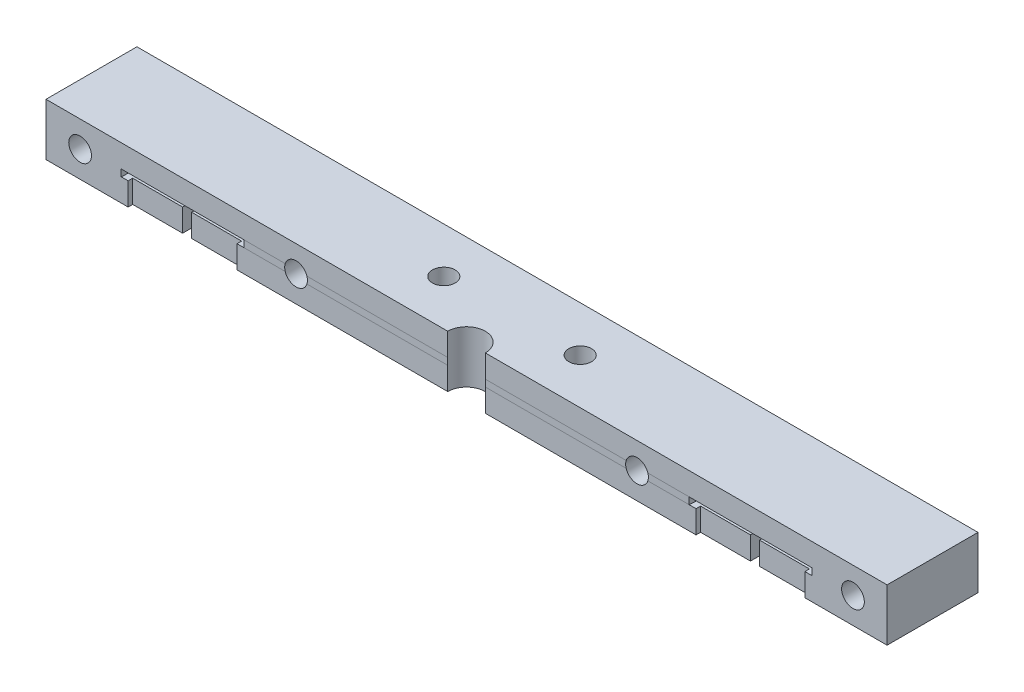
ISO-10303-21;
HEADER;
FILE_DESCRIPTION(('STEP AP214'),'2;1');
FILE_NAME('part.step','',(''),(''),'','','');
FILE_SCHEMA(('AUTOMOTIVE_DESIGN { 1 0 10303 214 1 1 1 1 }'));
ENDSEC;
DATA;
#1=APPLICATION_CONTEXT('core data for automotive mechanical design processes');
#2=APPLICATION_PROTOCOL_DEFINITION('international standard','automotive_design',2000,#1);
#3=PRODUCT_CONTEXT('',#1,'mechanical');
#4=PRODUCT('Part','Part','',(#3));
#5=PRODUCT_RELATED_PRODUCT_CATEGORY('part','',(#4));
#6=PRODUCT_DEFINITION_FORMATION('','',#4);
#7=PRODUCT_DEFINITION_CONTEXT('part definition',#1,'design');
#8=PRODUCT_DEFINITION('design','',#6,#7);
#9=PRODUCT_DEFINITION_SHAPE('','',#8);
#10=(LENGTH_UNIT() NAMED_UNIT(*) SI_UNIT(.MILLI.,.METRE.));
#11=(NAMED_UNIT(*) PLANE_ANGLE_UNIT() SI_UNIT($,.RADIAN.));
#12=(NAMED_UNIT(*) SI_UNIT($,.STERADIAN.) SOLID_ANGLE_UNIT());
#13=UNCERTAINTY_MEASURE_WITH_UNIT(LENGTH_MEASURE(1.E-05),#10,'distance_accuracy_value','');
#14=(GEOMETRIC_REPRESENTATION_CONTEXT(3) GLOBAL_UNCERTAINTY_ASSIGNED_CONTEXT((#13)) GLOBAL_UNIT_ASSIGNED_CONTEXT((#10,
#11,#12)) REPRESENTATION_CONTEXT('',''));
#15=CARTESIAN_POINT('',(0.,0.,0.));
#16=DIRECTION('',(0.,0.,1.));
#17=DIRECTION('',(1.,0.,0.));
#18=AXIS2_PLACEMENT_3D('',#15,#16,#17);
#19=CARTESIAN_POINT('',(462.575693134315,1024.01472375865,1286.48803447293));
#20=DIRECTION('',(1.47975290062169E-05,0.,-0.999999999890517));
#21=DIRECTION('',(-0.999999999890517,0.,-1.47975290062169E-05));
#22=AXIS2_PLACEMENT_3D('',#19,#20,#21);
#23=PLANE('',#22);
#24=CARTESIAN_POINT('',(417.979450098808,1024.01472375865,1286.48711447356));
#25=DIRECTION('',(1.,0.,0.));
#26=VECTOR('',#25,1.);
#27=LINE('',#24,#26);
#28=CARTESIAN_POINT('',(417.979450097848,1024.01472375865,1286.48717949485));
#29=VERTEX_POINT('',#28);
#30=CARTESIAN_POINT('',(457.325693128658,1024.01472375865,1286.48753562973));
#31=VERTEX_POINT('',#30);
#32=EDGE_CURVE('E669',#29,#31,#27,.T.);
#33=ORIENTED_EDGE('',*,*,#32,.F.);
#34=CARTESIAN_POINT('',(414.950693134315,1023.06222375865,1286.48732974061));
#35=DIRECTION('',(1.47975290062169E-05,0.,-0.999999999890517));
#36=DIRECTION('',(-0.999999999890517,2.35950295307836E-10,-1.47975290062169E-05));
#37=AXIS2_PLACEMENT_3D('',#34,#35,#36);
#38=ELLIPSE('',#37,3.17500000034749,3.17499999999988);
#39=CARTESIAN_POINT('',(417.979450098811,1022.10972375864,1286.48739449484));
#40=VERTEX_POINT('',#39);
#41=EDGE_CURVE('E11',#29,#40,#38,.T.);
#42=ORIENTED_EDGE('',*,*,#41,.T.);
#43=CARTESIAN_POINT('',(457.325693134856,1022.10972375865,1286.48795913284));
#44=DIRECTION('',(-0.999999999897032,0.,-1.43504934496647E-05));
#45=VECTOR('',#44,1.);
#46=LINE('',#43,#45);
#47=CARTESIAN_POINT('',(457.32569313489,1022.10972375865,1286.4879567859));
#48=VERTEX_POINT('',#47);
#49=EDGE_CURVE('E424',#48,#40,#46,.T.);
#50=ORIENTED_EDGE('',*,*,#49,.F.);
#51=DIRECTION('',(0.,-1.,0.));
#52=VECTOR('',#51,1.);
#53=CARTESIAN_POINT('',(457.32569313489,1030.36472375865,1286.4879567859));
#54=LINE('',#53,#52);
#55=EDGE_CURVE('E842',#48,#31,#54,.F.);
#56=ORIENTED_EDGE('',*,*,#55,.T.);
#57=EDGE_LOOP('',(#33,#42,#50,#56));
#58=FACE_BOUND('',#57,.T.);
#59=ADVANCED_FACE('F39',(#58),#23,.F.);
#60=CARTESIAN_POINT('',(462.575693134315,1024.01472375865,1286.48803447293));
#61=DIRECTION('',(-1.47975290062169E-05,0.,-0.999999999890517));
#62=DIRECTION('',(-0.999999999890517,0.,1.47975290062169E-05));
#63=AXIS2_PLACEMENT_3D('',#60,#61,#62);
#64=PLANE('',#63);
#65=CARTESIAN_POINT('',(467.82569313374,1022.10972375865,1286.4879567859));
#66=DIRECTION('',(0.999999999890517,0.,-1.47975290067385E-05));
#67=VECTOR('',#66,1.);
#68=LINE('',#65,#67);
#69=CARTESIAN_POINT('',(467.825693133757,1022.10972375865,1286.48795795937));
#70=VERTEX_POINT('',#69);
#71=CARTESIAN_POINT('',(507.171936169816,1022.10972375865,1286.48739449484));
#72=VERTEX_POINT('',#71);
#73=EDGE_CURVE('E331',#70,#72,#68,.T.);
#74=ORIENTED_EDGE('',*,*,#73,.T.);
#75=CARTESIAN_POINT('',(510.200693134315,1023.06222375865,1286.48732974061));
#76=DIRECTION('',(-1.47975290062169E-05,0.,-0.999999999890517));
#77=DIRECTION('',(0.999999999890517,2.35950295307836E-10,-1.47975290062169E-05));
#78=AXIS2_PLACEMENT_3D('',#75,#76,#77);
#79=ELLIPSE('',#78,3.17500000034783,3.17500000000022);
#80=CARTESIAN_POINT('',(507.171936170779,1024.01472375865,1286.48717949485));
#81=VERTEX_POINT('',#80);
#82=EDGE_CURVE('E260',#72,#81,#79,.T.);
#83=ORIENTED_EDGE('',*,*,#82,.T.);
#84=CARTESIAN_POINT('',(467.82569313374,1024.01472375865,1286.48711447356));
#85=DIRECTION('',(1.,0.,0.));
#86=VECTOR('',#85,1.);
#87=LINE('',#84,#86);
#88=CARTESIAN_POINT('',(467.825693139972,1024.01472375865,1286.48753562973));
#89=VERTEX_POINT('',#88);
#90=EDGE_CURVE('E267',#89,#81,#87,.T.);
#91=ORIENTED_EDGE('',*,*,#90,.F.);
#92=DIRECTION('',(0.,-1.,0.));
#93=VECTOR('',#92,1.);
#94=CARTESIAN_POINT('',(467.82569313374,1030.36472375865,1286.4879567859));
#95=LINE('',#94,#93);
#96=EDGE_CURVE('E813',#89,#70,#95,.T.);
#97=ORIENTED_EDGE('',*,*,#96,.T.);
#98=EDGE_LOOP('',(#74,#83,#91,#97));
#99=FACE_BOUND('',#98,.T.);
#100=ADVANCED_FACE('F306',(#99),#64,.F.);
#101=CARTESIAN_POINT('',(368.049943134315,1015.75972375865,1286.48711447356));
#102=DIRECTION('',(0.,0.,-1.));
#103=DIRECTION('',(0.,1.,0.));
#104=AXIS2_PLACEMENT_3D('',#101,#102,#103);
#105=PLANE('',#104);
#106=CARTESIAN_POINT('',(570.525693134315,1023.06222375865,1286.48711447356));
#107=DIRECTION('',(0.,0.,-1.));
#108=DIRECTION('',(0.,1.,0.));
#109=AXIS2_PLACEMENT_3D('',#106,#107,#108);
#110=CIRCLE('',#109,3.17500000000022);
#111=CARTESIAN_POINT('',(570.525693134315,1026.23722375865,1286.48711447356));
#112=VERTEX_POINT('',#111);
#113=EDGE_CURVE('E335',#112,#112,#110,.T.);
#114=ORIENTED_EDGE('',*,*,#113,.T.);
#115=EDGE_LOOP('',(#114));
#116=FACE_BOUND('',#115,.T.);
#117=ORIENTED_EDGE('',*,*,#90,.T.);
#118=CARTESIAN_POINT('',(510.200693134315,1023.06222375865,1286.48711447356));
#119=DIRECTION('',(0.,0.,-1.));
#120=DIRECTION('',(0.,1.,0.));
#121=AXIS2_PLACEMENT_3D('',#118,#119,#120);
#122=CIRCLE('',#121,3.17500000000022);
#123=CARTESIAN_POINT('',(513.229450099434,1024.01472375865,1286.48724231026));
#124=VERTEX_POINT('',#123);
#125=EDGE_CURVE('E255',#81,#124,#122,.T.);
#126=ORIENTED_EDGE('',*,*,#125,.T.);
#127=CARTESIAN_POINT('',(513.229450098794,1024.01472375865,1286.48711447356));
#128=DIRECTION('',(1.,0.,0.));
#129=VECTOR('',#128,1.);
#130=LINE('',#127,#129);
#131=CARTESIAN_POINT('',(524.748193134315,1024.01472375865,1286.48711447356));
#132=VERTEX_POINT('',#131);
#133=EDGE_CURVE('E263',#124,#132,#130,.T.);
#134=ORIENTED_EDGE('',*,*,#133,.T.);
#135=DIRECTION('',(1.,0.,0.));
#136=VECTOR('',#135,1.);
#137=CARTESIAN_POINT('',(368.049943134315,1024.01472375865,1286.48711447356));
#138=LINE('',#137,#136);
#139=CARTESIAN_POINT('',(559.038193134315,1024.01472375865,1286.48711447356));
#140=VERTEX_POINT('',#139);
#141=EDGE_CURVE('E706',#132,#140,#138,.T.);
#142=ORIENTED_EDGE('',*,*,#141,.T.);
#143=DIRECTION('',(0.,-1.,0.));
#144=VECTOR('',#143,1.);
#145=CARTESIAN_POINT('',(559.038193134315,1024.01472375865,1286.48711447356));
#146=LINE('',#145,#144);
#147=CARTESIAN_POINT('',(559.038193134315,1022.10972375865,1286.48711447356));
#148=VERTEX_POINT('',#147);
#149=EDGE_CURVE('E794',#140,#148,#146,.T.);
#150=ORIENTED_EDGE('',*,*,#149,.T.);
#151=DIRECTION('',(-1.,0.,0.));
#152=VECTOR('',#151,1.);
#153=CARTESIAN_POINT('',(557.101443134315,1022.10972375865,1286.48711447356));
#154=LINE('',#153,#152);
#155=CARTESIAN_POINT('',(557.101443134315,1022.10972375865,1286.48711447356));
#156=VERTEX_POINT('',#155);
#157=EDGE_CURVE('E631',#148,#156,#154,.T.);
#158=ORIENTED_EDGE('',*,*,#157,.T.);
#159=DIRECTION('',(0.,1.,0.));
#160=VECTOR('',#159,1.);
#161=CARTESIAN_POINT('',(557.101443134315,1015.75972375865,1286.48711447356));
#162=LINE('',#161,#160);
#163=CARTESIAN_POINT('',(557.101443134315,1015.75972375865,1286.48711447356));
#164=VERTEX_POINT('',#163);
#165=EDGE_CURVE('E499',#164,#156,#162,.T.);
#166=ORIENTED_EDGE('',*,*,#165,.F.);
#167=DIRECTION('',(-1.,0.,0.));
#168=VECTOR('',#167,1.);
#169=CARTESIAN_POINT('',(557.101443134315,1015.75972375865,1286.48711447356));
#170=LINE('',#169,#168);
#171=CARTESIAN_POINT('',(580.050693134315,1015.75972375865,1286.48711447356));
#172=VERTEX_POINT('',#171);
#173=EDGE_CURVE('E759',#172,#164,#170,.T.);
#174=ORIENTED_EDGE('',*,*,#173,.F.);
#175=DIRECTION('',(0.,1.,0.));
#176=VECTOR('',#175,1.);
#177=CARTESIAN_POINT('',(580.050693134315,1015.75972375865,1286.48711447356));
#178=LINE('',#177,#176);
#179=CARTESIAN_POINT('',(580.050693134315,1030.36472375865,1286.48711447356));
#180=VERTEX_POINT('',#179);
#181=EDGE_CURVE('E505',#172,#180,#178,.T.);
#182=ORIENTED_EDGE('',*,*,#181,.T.);
#183=DIRECTION('',(1.,0.,0.));
#184=VECTOR('',#183,1.);
#185=CARTESIAN_POINT('',(580.050693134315,1030.36472375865,1286.48711447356));
#186=LINE('',#185,#184);
#187=CARTESIAN_POINT('',(467.825693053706,1030.36472375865,1286.48711447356));
#188=VERTEX_POINT('',#187);
#189=EDGE_CURVE('E712',#188,#180,#186,.T.);
#190=ORIENTED_EDGE('',*,*,#189,.F.);
#191=DIRECTION('',(0.,-1.,0.));
#192=VECTOR('',#191,1.);
#193=CARTESIAN_POINT('',(467.825693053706,1030.36472375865,1286.48711447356));
#194=LINE('',#193,#192);
#195=EDGE_CURVE('E809',#188,#89,#194,.T.);
#196=ORIENTED_EDGE('',*,*,#195,.T.);
#197=EDGE_LOOP('',(#117,#126,#134,#142,#150,#158,#166,#174,#182,#190,#196));
#198=FACE_BOUND('',#197,.T.);
#199=ADVANCED_FACE('F262',(#116,#198),#105,.F.);
#200=CARTESIAN_POINT('',(0.,1015.75972375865,0.));
#201=DIRECTION('',(0.,1.,0.));
#202=DIRECTION('',(0.,0.,1.));
#203=AXIS2_PLACEMENT_3D('',#200,#201,#202);
#204=PLANE('',#203);
#205=CARTESIAN_POINT('',(443.525693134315,1015.75972375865,1273.78803447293));
#206=DIRECTION('',(0.,-1.,0.));
#207=DIRECTION('',(0.,0.,-1.));
#208=AXIS2_PLACEMENT_3D('',#205,#206,#207);
#209=CIRCLE('',#208,3.17499999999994);
#210=CARTESIAN_POINT('',(443.525693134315,1015.75972375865,1270.61303447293));
#211=VERTEX_POINT('',#210);
#212=EDGE_CURVE('E884',#211,#211,#209,.T.);
#213=ORIENTED_EDGE('',*,*,#212,.F.);
#214=EDGE_LOOP('',(#213));
#215=FACE_BOUND('',#214,.T.);
#216=CARTESIAN_POINT('',(481.625693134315,1015.75972375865,1273.78803447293));
#217=DIRECTION('',(0.,-1.,0.));
#218=DIRECTION('',(0.,0.,-1.));
#219=AXIS2_PLACEMENT_3D('',#216,#217,#218);
#220=CIRCLE('',#219,3.17499999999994);
#221=CARTESIAN_POINT('',(481.625693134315,1015.75972375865,1270.61303447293));
#222=VERTEX_POINT('',#221);
#223=EDGE_CURVE('E890',#222,#222,#220,.T.);
#224=ORIENTED_EDGE('',*,*,#223,.F.);
#225=EDGE_LOOP('',(#224));
#226=FACE_BOUND('',#225,.T.);
#227=CARTESIAN_POINT('',(462.575693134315,1015.75972375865,1286.48803447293));
#228=DIRECTION('',(0.,-1.,0.));
#229=DIRECTION('',(0.,0.,-1.));
#230=AXIS2_PLACEMENT_3D('',#227,#228,#229);
#231=CIRCLE('',#230,5.25000000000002);
#232=CARTESIAN_POINT('',(457.325693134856,1015.75972375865,1286.48795913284));
#233=VERTEX_POINT('',#232);
#234=CARTESIAN_POINT('',(467.825693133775,1015.75972375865,1286.48795913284));
#235=VERTEX_POINT('',#234);
#236=EDGE_CURVE('E787',#233,#235,#231,.T.);
#237=ORIENTED_EDGE('',*,*,#236,.F.);
#238=DIRECTION('',(-0.999999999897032,0.,-1.4350493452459E-05));
#239=VECTOR('',#238,1.);
#240=CARTESIAN_POINT('',(398.466443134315,1015.75972375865,1286.48711447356));
#241=LINE('',#240,#239);
#242=CARTESIAN_POINT('',(398.466443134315,1015.75972375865,1286.48711447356));
#243=VERTEX_POINT('',#242);
#244=EDGE_CURVE('E776',#233,#243,#241,.T.);
#245=ORIENTED_EDGE('',*,*,#244,.T.);
#246=DIRECTION('',(0.,0.,-1.));
#247=VECTOR('',#246,1.);
#248=CARTESIAN_POINT('',(398.466443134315,1015.75972375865,1286.48711447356));
#249=LINE('',#248,#247);
#250=CARTESIAN_POINT('',(398.466443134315,1015.75972375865,1285.21711447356));
#251=VERTEX_POINT('',#250);
#252=EDGE_CURVE('E781',#243,#251,#249,.T.);
#253=ORIENTED_EDGE('',*,*,#252,.T.);
#254=DIRECTION('',(-1.,0.,0.));
#255=VECTOR('',#254,1.);
#256=CARTESIAN_POINT('',(398.466443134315,1015.75972375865,1285.21711447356));
#257=LINE('',#256,#255);
#258=CARTESIAN_POINT('',(384.528193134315,1015.75972375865,1285.21711447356));
#259=VERTEX_POINT('',#258);
#260=EDGE_CURVE('E784',#251,#259,#257,.T.);
#261=ORIENTED_EDGE('',*,*,#260,.T.);
#262=DIRECTION('',(0.,0.,-1.));
#263=VECTOR('',#262,1.);
#264=CARTESIAN_POINT('',(384.528193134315,1015.75972375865,1285.21711447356));
#265=LINE('',#264,#263);
#266=CARTESIAN_POINT('',(384.528193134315,1015.75972375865,1271.27886447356));
#267=VERTEX_POINT('',#266);
#268=EDGE_CURVE('E785',#259,#267,#265,.T.);
#269=ORIENTED_EDGE('',*,*,#268,.T.);
#270=DIRECTION('',(-1.,0.,0.));
#271=VECTOR('',#270,1.);
#272=CARTESIAN_POINT('',(381.988193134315,1015.75972375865,1271.27886447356));
#273=LINE('',#272,#271);
#274=CARTESIAN_POINT('',(381.988193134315,1015.75972375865,1271.27886447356));
#275=VERTEX_POINT('',#274);
#276=EDGE_CURVE('E609',#267,#275,#273,.T.);
#277=ORIENTED_EDGE('',*,*,#276,.T.);
#278=DIRECTION('',(0.,0.,1.));
#279=VECTOR('',#278,1.);
#280=CARTESIAN_POINT('',(381.988193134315,1015.75972375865,1285.21711447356));
#281=LINE('',#280,#279);
#282=CARTESIAN_POINT('',(381.988193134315,1015.75972375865,1285.21711447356));
#283=VERTEX_POINT('',#282);
#284=EDGE_CURVE('E625',#275,#283,#281,.T.);
#285=ORIENTED_EDGE('',*,*,#284,.T.);
#286=DIRECTION('',(-1.,0.,0.));
#287=VECTOR('',#286,1.);
#288=CARTESIAN_POINT('',(368.049943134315,1015.75972375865,1285.21711447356));
#289=LINE('',#288,#287);
#290=CARTESIAN_POINT('',(368.049943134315,1015.75972375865,1285.21711447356));
#291=VERTEX_POINT('',#290);
#292=EDGE_CURVE('E616',#283,#291,#289,.T.);
#293=ORIENTED_EDGE('',*,*,#292,.T.);
#294=DIRECTION('',(0.,0.,1.));
#295=VECTOR('',#294,1.);
#296=CARTESIAN_POINT('',(368.049943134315,1015.75972375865,1286.48711447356));
#297=LINE('',#296,#295);
#298=CARTESIAN_POINT('',(368.049943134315,1015.75972375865,1286.48711447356));
#299=VERTEX_POINT('',#298);
#300=EDGE_CURVE('E623',#291,#299,#297,.T.);
#301=ORIENTED_EDGE('',*,*,#300,.T.);
#302=DIRECTION('',(-1.,0.,0.));
#303=VECTOR('',#302,1.);
#304=CARTESIAN_POINT('',(368.049943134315,1015.75972375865,1286.48711447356));
#305=LINE('',#304,#303);
#306=CARTESIAN_POINT('',(345.100693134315,1015.75972375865,1286.48711447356));
#307=VERTEX_POINT('',#306);
#308=EDGE_CURVE('E624',#299,#307,#305,.T.);
#309=ORIENTED_EDGE('',*,*,#308,.T.);
#310=DIRECTION('',(0.,0.,-1.));
#311=VECTOR('',#310,1.);
#312=CARTESIAN_POINT('',(345.100693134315,1015.75972375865,1286.48711447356));
#313=LINE('',#312,#311);
#314=CARTESIAN_POINT('',(345.100693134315,1015.75972375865,1261.08711447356));
#315=VERTEX_POINT('',#314);
#316=EDGE_CURVE('E590',#307,#315,#313,.T.);
#317=ORIENTED_EDGE('',*,*,#316,.T.);
#318=DIRECTION('',(1.,0.,0.));
#319=VECTOR('',#318,1.);
#320=CARTESIAN_POINT('',(345.100693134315,1015.75972375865,1261.08711447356));
#321=LINE('',#320,#319);
#322=CARTESIAN_POINT('',(580.050693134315,1015.75972375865,1261.08711447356));
#323=VERTEX_POINT('',#322);
#324=EDGE_CURVE('E586',#315,#323,#321,.T.);
#325=ORIENTED_EDGE('',*,*,#324,.T.);
#326=DIRECTION('',(0.,0.,1.));
#327=VECTOR('',#326,1.);
#328=CARTESIAN_POINT('',(580.050693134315,1015.75972375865,1286.48711447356));
#329=LINE('',#328,#327);
#330=EDGE_CURVE('E758',#323,#172,#329,.T.);
#331=ORIENTED_EDGE('',*,*,#330,.T.);
#332=ORIENTED_EDGE('',*,*,#173,.T.);
#333=DIRECTION('',(0.,0.,-1.));
#334=VECTOR('',#333,1.);
#335=CARTESIAN_POINT('',(557.101443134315,1015.75972375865,1286.48711447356));
#336=LINE('',#335,#334);
#337=CARTESIAN_POINT('',(557.101443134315,1015.75972375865,1285.21711447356));
#338=VERTEX_POINT('',#337);
#339=EDGE_CURVE('E765',#164,#338,#336,.T.);
#340=ORIENTED_EDGE('',*,*,#339,.T.);
#341=DIRECTION('',(-1.,0.,0.));
#342=VECTOR('',#341,1.);
#343=CARTESIAN_POINT('',(557.101443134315,1015.75972375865,1285.21711447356));
#344=LINE('',#343,#342);
#345=CARTESIAN_POINT('',(543.163193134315,1015.75972375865,1285.21711447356));
#346=VERTEX_POINT('',#345);
#347=EDGE_CURVE('E762',#338,#346,#344,.T.);
#348=ORIENTED_EDGE('',*,*,#347,.T.);
#349=DIRECTION('',(0.,0.,-1.));
#350=VECTOR('',#349,1.);
#351=CARTESIAN_POINT('',(543.163193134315,1015.75972375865,1285.21711447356));
#352=LINE('',#351,#350);
#353=CARTESIAN_POINT('',(543.163193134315,1015.75972375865,1271.27886447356));
#354=VERTEX_POINT('',#353);
#355=EDGE_CURVE('E766',#346,#354,#352,.T.);
#356=ORIENTED_EDGE('',*,*,#355,.T.);
#357=DIRECTION('',(-1.,0.,0.));
#358=VECTOR('',#357,1.);
#359=CARTESIAN_POINT('',(543.163193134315,1015.75972375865,1271.27886447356));
#360=LINE('',#359,#358);
#361=CARTESIAN_POINT('',(540.623193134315,1015.75972375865,1271.27886447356));
#362=VERTEX_POINT('',#361);
#363=EDGE_CURVE('E767',#354,#362,#360,.T.);
#364=ORIENTED_EDGE('',*,*,#363,.T.);
#365=DIRECTION('',(0.,0.,1.));
#366=VECTOR('',#365,1.);
#367=CARTESIAN_POINT('',(540.623193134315,1015.75972375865,1285.21711447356));
#368=LINE('',#367,#366);
#369=CARTESIAN_POINT('',(540.623193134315,1015.75972375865,1285.21711447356));
#370=VERTEX_POINT('',#369);
#371=EDGE_CURVE('E769',#362,#370,#368,.T.);
#372=ORIENTED_EDGE('',*,*,#371,.T.);
#373=DIRECTION('',(-1.,0.,0.));
#374=VECTOR('',#373,1.);
#375=CARTESIAN_POINT('',(526.684943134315,1015.75972375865,1285.21711447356));
#376=LINE('',#375,#374);
#377=CARTESIAN_POINT('',(526.684943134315,1015.75972375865,1285.21711447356));
#378=VERTEX_POINT('',#377);
#379=EDGE_CURVE('E775',#370,#378,#376,.T.);
#380=ORIENTED_EDGE('',*,*,#379,.T.);
#381=DIRECTION('',(0.,0.,1.));
#382=VECTOR('',#381,1.);
#383=CARTESIAN_POINT('',(526.684943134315,1015.75972375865,1286.48711447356));
#384=LINE('',#383,#382);
#385=CARTESIAN_POINT('',(526.684943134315,1015.75972375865,1286.48711447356));
#386=VERTEX_POINT('',#385);
#387=EDGE_CURVE('E771',#378,#386,#384,.T.);
#388=ORIENTED_EDGE('',*,*,#387,.T.);
#389=DIRECTION('',(-0.999999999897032,0.,1.4350493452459E-05));
#390=VECTOR('',#389,1.);
#391=CARTESIAN_POINT('',(526.684943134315,1015.75972375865,1286.48711447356));
#392=LINE('',#391,#390);
#393=EDGE_CURVE('E777',#386,#235,#392,.T.);
#394=ORIENTED_EDGE('',*,*,#393,.T.);
#395=EDGE_LOOP('',(#237,#245,#253,#261,#269,#277,#285,#293,#301,#309,#317,#325,#331,#332,#340,
#348,#356,#364,#372,#380,#388,#394));
#396=FACE_BOUND('',#395,.T.);
#397=ADVANCED_FACE('F790',(#215,#226,#396),#204,.F.);
#398=CARTESIAN_POINT('',(0.,1022.10972375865,0.));
#399=DIRECTION('',(0.,1.,0.));
#400=DIRECTION('',(0.,0.,1.));
#401=AXIS2_PLACEMENT_3D('',#398,#399,#400);
#402=PLANE('',#401);
#403=CARTESIAN_POINT('',(383.258193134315,1022.10972375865,1286.48711447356));
#404=DIRECTION('',(0.,-1.,0.));
#405=DIRECTION('',(0.,0.,-1.));
#406=AXIS2_PLACEMENT_3D('',#403,#404,#405);
#407=CIRCLE('',#406,17.145);
#408=CARTESIAN_POINT('',(366.113193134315,1022.10972375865,1286.48711447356));
#409=VERTEX_POINT('',#408);
#410=CARTESIAN_POINT('',(400.403193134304,1022.10972375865,1286.48712837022));
#411=VERTEX_POINT('',#410);
#412=EDGE_CURVE('E745',#409,#411,#407,.T.);
#413=ORIENTED_EDGE('',*,*,#412,.F.);
#414=DIRECTION('',(-1.,0.,0.));
#415=VECTOR('',#414,1.);
#416=CARTESIAN_POINT('',(368.049943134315,1022.10972375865,1286.48711447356));
#417=LINE('',#416,#415);
#418=CARTESIAN_POINT('',(368.049943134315,1022.10972375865,1286.48711447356));
#419=VERTEX_POINT('',#418);
#420=EDGE_CURVE('E584',#419,#409,#417,.T.);
#421=ORIENTED_EDGE('',*,*,#420,.F.);
#422=DIRECTION('',(0.,0.,1.));
#423=VECTOR('',#422,1.);
#424=CARTESIAN_POINT('',(368.049943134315,1022.10972375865,1286.48711447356));
#425=LINE('',#424,#423);
#426=CARTESIAN_POINT('',(368.049943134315,1022.10972375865,1285.21711447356));
#427=VERTEX_POINT('',#426);
#428=EDGE_CURVE('E582',#427,#419,#425,.T.);
#429=ORIENTED_EDGE('',*,*,#428,.F.);
#430=DIRECTION('',(-1.,0.,0.));
#431=VECTOR('',#430,1.);
#432=CARTESIAN_POINT('',(368.049943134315,1022.10972375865,1285.21711447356));
#433=LINE('',#432,#431);
#434=CARTESIAN_POINT('',(381.988193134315,1022.10972375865,1285.21711447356));
#435=VERTEX_POINT('',#434);
#436=EDGE_CURVE('E576',#435,#427,#433,.T.);
#437=ORIENTED_EDGE('',*,*,#436,.F.);
#438=DIRECTION('',(0.,0.,1.));
#439=VECTOR('',#438,1.);
#440=CARTESIAN_POINT('',(381.988193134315,1022.10972375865,1285.21711447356));
#441=LINE('',#440,#439);
#442=CARTESIAN_POINT('',(381.988193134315,1022.10972375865,1271.27886447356));
#443=VERTEX_POINT('',#442);
#444=EDGE_CURVE('E580',#443,#435,#441,.T.);
#445=ORIENTED_EDGE('',*,*,#444,.F.);
#446=DIRECTION('',(-1.,0.,0.));
#447=VECTOR('',#446,1.);
#448=CARTESIAN_POINT('',(381.988193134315,1022.10972375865,1271.27886447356));
#449=LINE('',#448,#447);
#450=CARTESIAN_POINT('',(384.528193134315,1022.10972375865,1271.27886447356));
#451=VERTEX_POINT('',#450);
#452=EDGE_CURVE('E569',#451,#443,#449,.T.);
#453=ORIENTED_EDGE('',*,*,#452,.F.);
#454=DIRECTION('',(0.,0.,-1.));
#455=VECTOR('',#454,1.);
#456=CARTESIAN_POINT('',(384.528193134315,1022.10972375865,1285.21711447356));
#457=LINE('',#456,#455);
#458=CARTESIAN_POINT('',(384.528193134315,1022.10972375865,1285.21711447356));
#459=VERTEX_POINT('',#458);
#460=EDGE_CURVE('E570',#459,#451,#457,.T.);
#461=ORIENTED_EDGE('',*,*,#460,.F.);
#462=DIRECTION('',(-1.,0.,0.));
#463=VECTOR('',#462,1.);
#464=CARTESIAN_POINT('',(398.466443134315,1022.10972375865,1285.21711447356));
#465=LINE('',#464,#463);
#466=CARTESIAN_POINT('',(398.466443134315,1022.10972375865,1285.21711447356));
#467=VERTEX_POINT('',#466);
#468=EDGE_CURVE('E566',#467,#459,#465,.T.);
#469=ORIENTED_EDGE('',*,*,#468,.F.);
#470=DIRECTION('',(0.,0.,-1.));
#471=VECTOR('',#470,1.);
#472=CARTESIAN_POINT('',(398.466443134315,1022.10972375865,1286.48711447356));
#473=LINE('',#472,#471);
#474=CARTESIAN_POINT('',(398.466443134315,1022.10972375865,1286.48711447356));
#475=VERTEX_POINT('',#474);
#476=EDGE_CURVE('E345',#475,#467,#473,.T.);
#477=ORIENTED_EDGE('',*,*,#476,.F.);
#478=DIRECTION('',(-0.999999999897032,0.,-1.4350493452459E-05));
#479=VECTOR('',#478,1.);
#480=CARTESIAN_POINT('',(398.466443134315,1022.10972375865,1286.48711447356));
#481=LINE('',#480,#479);
#482=EDGE_CURVE('E428',#411,#475,#481,.T.);
#483=ORIENTED_EDGE('',*,*,#482,.F.);
#484=EDGE_LOOP('',(#413,#421,#429,#437,#445,#453,#461,#469,#477,#483));
#485=FACE_BOUND('',#484,.T.);
#486=ADVANCED_FACE('F612',(#485),#402,.T.);
#487=CARTESIAN_POINT('',(541.893193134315,1022.10972375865,1286.48711447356));
#488=DIRECTION('',(0.,-1.,0.));
#489=DIRECTION('',(0.,0.,1.));
#490=AXIS2_PLACEMENT_3D('',#487,#488,#489);
#491=CIRCLE('',#490,17.145);
#492=CARTESIAN_POINT('',(524.748193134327,1022.10972375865,1286.48712837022));
#493=VERTEX_POINT('',#492);
#494=EDGE_CURVE('E746',#493,#148,#491,.T.);
#495=ORIENTED_EDGE('',*,*,#494,.F.);
#496=DIRECTION('',(-0.999999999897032,0.,1.4350493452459E-05));
#497=VECTOR('',#496,1.);
#498=CARTESIAN_POINT('',(526.684943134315,1022.10972375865,1286.48711447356));
#499=LINE('',#498,#497);
#500=CARTESIAN_POINT('',(526.684943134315,1022.10972375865,1286.48711447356));
#501=VERTEX_POINT('',#500);
#502=EDGE_CURVE('E643',#501,#493,#499,.T.);
#503=ORIENTED_EDGE('',*,*,#502,.F.);
#504=DIRECTION('',(0.,0.,1.));
#505=VECTOR('',#504,1.);
#506=CARTESIAN_POINT('',(526.684943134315,1022.10972375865,1286.48711447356));
#507=LINE('',#506,#505);
#508=CARTESIAN_POINT('',(526.684943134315,1022.10972375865,1285.21711447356));
#509=VERTEX_POINT('',#508);
#510=EDGE_CURVE('E341',#509,#501,#507,.T.);
#511=ORIENTED_EDGE('',*,*,#510,.F.);
#512=DIRECTION('',(-1.,0.,0.));
#513=VECTOR('',#512,1.);
#514=CARTESIAN_POINT('',(526.684943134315,1022.10972375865,1285.21711447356));
#515=LINE('',#514,#513);
#516=CARTESIAN_POINT('',(540.623193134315,1022.10972375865,1285.21711447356));
#517=VERTEX_POINT('',#516);
#518=EDGE_CURVE('E572',#517,#509,#515,.T.);
#519=ORIENTED_EDGE('',*,*,#518,.F.);
#520=DIRECTION('',(0.,0.,1.));
#521=VECTOR('',#520,1.);
#522=CARTESIAN_POINT('',(540.623193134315,1022.10972375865,1285.21711447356));
#523=LINE('',#522,#521);
#524=CARTESIAN_POINT('',(540.623193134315,1022.10972375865,1271.27886447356));
#525=VERTEX_POINT('',#524);
#526=EDGE_CURVE('E639',#525,#517,#523,.T.);
#527=ORIENTED_EDGE('',*,*,#526,.F.);
#528=DIRECTION('',(-1.,0.,0.));
#529=VECTOR('',#528,1.);
#530=CARTESIAN_POINT('',(543.163193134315,1022.10972375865,1271.27886447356));
#531=LINE('',#530,#529);
#532=CARTESIAN_POINT('',(543.163193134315,1022.10972375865,1271.27886447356));
#533=VERTEX_POINT('',#532);
#534=EDGE_CURVE('E638',#533,#525,#531,.T.);
#535=ORIENTED_EDGE('',*,*,#534,.F.);
#536=DIRECTION('',(0.,0.,-1.));
#537=VECTOR('',#536,1.);
#538=CARTESIAN_POINT('',(543.163193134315,1022.10972375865,1285.21711447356));
#539=LINE('',#538,#537);
#540=CARTESIAN_POINT('',(543.163193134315,1022.10972375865,1285.21711447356));
#541=VERTEX_POINT('',#540);
#542=EDGE_CURVE('E640',#541,#533,#539,.T.);
#543=ORIENTED_EDGE('',*,*,#542,.F.);
#544=DIRECTION('',(-1.,0.,0.));
#545=VECTOR('',#544,1.);
#546=CARTESIAN_POINT('',(557.101443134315,1022.10972375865,1285.21711447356));
#547=LINE('',#546,#545);
#548=CARTESIAN_POINT('',(557.101443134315,1022.10972375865,1285.21711447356));
#549=VERTEX_POINT('',#548);
#550=EDGE_CURVE('E634',#549,#541,#547,.T.);
#551=ORIENTED_EDGE('',*,*,#550,.F.);
#552=DIRECTION('',(0.,0.,-1.));
#553=VECTOR('',#552,1.);
#554=CARTESIAN_POINT('',(557.101443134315,1022.10972375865,1286.48711447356));
#555=LINE('',#554,#553);
#556=EDGE_CURVE('E633',#156,#549,#555,.T.);
#557=ORIENTED_EDGE('',*,*,#556,.F.);
#558=ORIENTED_EDGE('',*,*,#157,.F.);
#559=EDGE_LOOP('',(#495,#503,#511,#519,#527,#535,#543,#551,#557,#558));
#560=FACE_BOUND('',#559,.T.);
#561=ADVANCED_FACE('F395',(#560),#402,.T.);
#562=CARTESIAN_POINT('',(345.100693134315,1015.75972375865,1261.08711447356));
#563=DIRECTION('',(0.,0.,1.));
#564=DIRECTION('',(0.,-1.,0.));
#565=AXIS2_PLACEMENT_3D('',#562,#563,#564);
#566=PLANE('',#565);
#567=CARTESIAN_POINT('',(510.200693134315,1023.06222375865,1261.08711447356));
#568=DIRECTION('',(0.,0.,-1.));
#569=DIRECTION('',(0.,1.,0.));
#570=AXIS2_PLACEMENT_3D('',#567,#568,#569);
#571=CIRCLE('',#570,3.17500000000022);
#572=CARTESIAN_POINT('',(510.200693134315,1026.23722375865,1261.08711447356));
#573=VERTEX_POINT('',#572);
#574=EDGE_CURVE('E818',#573,#573,#571,.T.);
#575=ORIENTED_EDGE('',*,*,#574,.F.);
#576=EDGE_LOOP('',(#575));
#577=FACE_BOUND('',#576,.T.);
#578=CARTESIAN_POINT('',(414.950693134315,1023.06222375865,1261.08711447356));
#579=DIRECTION('',(0.,0.,-1.));
#580=DIRECTION('',(0.,1.,0.));
#581=AXIS2_PLACEMENT_3D('',#578,#579,#580);
#582=CIRCLE('',#581,3.17499999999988);
#583=CARTESIAN_POINT('',(414.950693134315,1026.23722375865,1261.08711447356));
#584=VERTEX_POINT('',#583);
#585=EDGE_CURVE('E819',#584,#584,#582,.T.);
#586=ORIENTED_EDGE('',*,*,#585,.F.);
#587=EDGE_LOOP('',(#586));
#588=FACE_BOUND('',#587,.T.);
#589=CARTESIAN_POINT('',(570.525693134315,1023.06222375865,1261.08711447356));
#590=DIRECTION('',(0.,0.,-1.));
#591=DIRECTION('',(0.,1.,0.));
#592=AXIS2_PLACEMENT_3D('',#589,#590,#591);
#593=CIRCLE('',#592,3.17500000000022);
#594=CARTESIAN_POINT('',(570.525693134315,1026.23722375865,1261.08711447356));
#595=VERTEX_POINT('',#594);
#596=EDGE_CURVE('E720',#595,#595,#593,.T.);
#597=ORIENTED_EDGE('',*,*,#596,.F.);
#598=EDGE_LOOP('',(#597));
#599=FACE_BOUND('',#598,.T.);
#600=CARTESIAN_POINT('',(354.625693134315,1023.06222375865,1261.08711447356));
#601=DIRECTION('',(0.,0.,-1.));
#602=DIRECTION('',(0.,1.,0.));
#603=AXIS2_PLACEMENT_3D('',#600,#601,#602);
#604=CIRCLE('',#603,3.17499999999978);
#605=CARTESIAN_POINT('',(354.625693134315,1026.23722375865,1261.08711447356));
#606=VERTEX_POINT('',#605);
#607=EDGE_CURVE('E722',#606,#606,#604,.T.);
#608=ORIENTED_EDGE('',*,*,#607,.F.);
#609=EDGE_LOOP('',(#608));
#610=FACE_BOUND('',#609,.T.);
#611=DIRECTION('',(0.,1.,0.));
#612=VECTOR('',#611,1.);
#613=CARTESIAN_POINT('',(345.100693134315,1015.75972375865,1261.08711447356));
#614=LINE('',#613,#612);
#615=CARTESIAN_POINT('',(345.100693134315,1030.36472375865,1261.08711447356));
#616=VERTEX_POINT('',#615);
#617=EDGE_CURVE('E587',#315,#616,#614,.T.);
#618=ORIENTED_EDGE('',*,*,#617,.T.);
#619=DIRECTION('',(-1.,0.,0.));
#620=VECTOR('',#619,1.);
#621=CARTESIAN_POINT('',(345.100693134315,1030.36472375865,1261.08711447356));
#622=LINE('',#621,#620);
#623=CARTESIAN_POINT('',(580.050693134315,1030.36472375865,1261.08711447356));
#624=VERTEX_POINT('',#623);
#625=EDGE_CURVE('E440',#624,#616,#622,.T.);
#626=ORIENTED_EDGE('',*,*,#625,.F.);
#627=DIRECTION('',(0.,1.,0.));
#628=VECTOR('',#627,1.);
#629=CARTESIAN_POINT('',(580.050693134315,1015.75972375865,1261.08711447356));
#630=LINE('',#629,#628);
#631=EDGE_CURVE('E451',#323,#624,#630,.T.);
#632=ORIENTED_EDGE('',*,*,#631,.F.);
#633=ORIENTED_EDGE('',*,*,#324,.F.);
#634=EDGE_LOOP('',(#618,#626,#632,#633));
#635=FACE_BOUND('',#634,.T.);
#636=ADVANCED_FACE('F41',(#577,#588,#599,#610,#635),#566,.F.);
#637=CARTESIAN_POINT('',(580.050693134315,1015.75972375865,1286.48711447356));
#638=DIRECTION('',(-1.,0.,0.));
#639=DIRECTION('',(0.,0.,1.));
#640=AXIS2_PLACEMENT_3D('',#637,#638,#639);
#641=PLANE('',#640);
#642=ORIENTED_EDGE('',*,*,#631,.T.);
#643=DIRECTION('',(0.,0.,-1.));
#644=VECTOR('',#643,1.);
#645=CARTESIAN_POINT('',(580.050693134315,1030.36472375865,1261.08711447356));
#646=LINE('',#645,#644);
#647=EDGE_CURVE('E739',#180,#624,#646,.T.);
#648=ORIENTED_EDGE('',*,*,#647,.F.);
#649=ORIENTED_EDGE('',*,*,#181,.F.);
#650=ORIENTED_EDGE('',*,*,#330,.F.);
#651=EDGE_LOOP('',(#642,#648,#649,#650));
#652=FACE_BOUND('',#651,.T.);
#653=ADVANCED_FACE('F387',(#652),#641,.F.);
#654=CARTESIAN_POINT('',(557.101443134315,1015.75972375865,1286.48711447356));
#655=DIRECTION('',(1.,0.,0.));
#656=DIRECTION('',(0.,0.,-1.));
#657=AXIS2_PLACEMENT_3D('',#654,#655,#656);
#658=PLANE('',#657);
#659=ORIENTED_EDGE('',*,*,#556,.T.);
#660=DIRECTION('',(0.,1.,0.));
#661=VECTOR('',#660,1.);
#662=CARTESIAN_POINT('',(557.101443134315,1015.75972375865,1285.21711447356));
#663=LINE('',#662,#661);
#664=EDGE_CURVE('E498',#338,#549,#663,.T.);
#665=ORIENTED_EDGE('',*,*,#664,.F.);
#666=ORIENTED_EDGE('',*,*,#339,.F.);
#667=ORIENTED_EDGE('',*,*,#165,.T.);
#668=EDGE_LOOP('',(#659,#665,#666,#667));
#669=FACE_BOUND('',#668,.T.);
#670=ADVANCED_FACE('F384',(#669),#658,.F.);
#671=CARTESIAN_POINT('',(557.101443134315,1015.75972375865,1285.21711447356));
#672=DIRECTION('',(0.,0.,-1.));
#673=DIRECTION('',(0.,1.,0.));
#674=AXIS2_PLACEMENT_3D('',#671,#672,#673);
#675=PLANE('',#674);
#676=ORIENTED_EDGE('',*,*,#550,.T.);
#677=DIRECTION('',(0.,1.,0.));
#678=VECTOR('',#677,1.);
#679=CARTESIAN_POINT('',(543.163193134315,1015.75972375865,1285.21711447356));
#680=LINE('',#679,#678);
#681=EDGE_CURVE('E492',#346,#541,#680,.T.);
#682=ORIENTED_EDGE('',*,*,#681,.F.);
#683=ORIENTED_EDGE('',*,*,#347,.F.);
#684=ORIENTED_EDGE('',*,*,#664,.T.);
#685=EDGE_LOOP('',(#676,#682,#683,#684));
#686=FACE_BOUND('',#685,.T.);
#687=ADVANCED_FACE('F378',(#686),#675,.F.);
#688=CARTESIAN_POINT('',(543.163193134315,1015.75972375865,1285.21711447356));
#689=DIRECTION('',(1.,0.,0.));
#690=DIRECTION('',(0.,0.,-1.));
#691=AXIS2_PLACEMENT_3D('',#688,#689,#690);
#692=PLANE('',#691);
#693=ORIENTED_EDGE('',*,*,#542,.T.);
#694=DIRECTION('',(0.,1.,0.));
#695=VECTOR('',#694,1.);
#696=CARTESIAN_POINT('',(543.163193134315,1015.75972375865,1271.27886447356));
#697=LINE('',#696,#695);
#698=EDGE_CURVE('E495',#354,#533,#697,.T.);
#699=ORIENTED_EDGE('',*,*,#698,.F.);
#700=ORIENTED_EDGE('',*,*,#355,.F.);
#701=ORIENTED_EDGE('',*,*,#681,.T.);
#702=EDGE_LOOP('',(#693,#699,#700,#701));
#703=FACE_BOUND('',#702,.T.);
#704=ADVANCED_FACE('F374',(#703),#692,.F.);
#705=CARTESIAN_POINT('',(543.163193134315,1015.75972375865,1271.27886447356));
#706=DIRECTION('',(0.,0.,-1.));
#707=DIRECTION('',(0.,1.,0.));
#708=AXIS2_PLACEMENT_3D('',#705,#706,#707);
#709=PLANE('',#708);
#710=ORIENTED_EDGE('',*,*,#534,.T.);
#711=DIRECTION('',(0.,1.,0.));
#712=VECTOR('',#711,1.);
#713=CARTESIAN_POINT('',(540.623193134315,1015.75972375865,1271.27886447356));
#714=LINE('',#713,#712);
#715=EDGE_CURVE('E490',#362,#525,#714,.T.);
#716=ORIENTED_EDGE('',*,*,#715,.F.);
#717=ORIENTED_EDGE('',*,*,#363,.F.);
#718=ORIENTED_EDGE('',*,*,#698,.T.);
#719=EDGE_LOOP('',(#710,#716,#717,#718));
#720=FACE_BOUND('',#719,.T.);
#721=ADVANCED_FACE('F371',(#720),#709,.F.);
#722=CARTESIAN_POINT('',(540.623193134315,1015.75972375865,1285.21711447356));
#723=DIRECTION('',(-1.,0.,0.));
#724=DIRECTION('',(0.,0.,1.));
#725=AXIS2_PLACEMENT_3D('',#722,#723,#724);
#726=PLANE('',#725);
#727=ORIENTED_EDGE('',*,*,#526,.T.);
#728=DIRECTION('',(0.,1.,0.));
#729=VECTOR('',#728,1.);
#730=CARTESIAN_POINT('',(540.623193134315,1015.75972375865,1285.21711447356));
#731=LINE('',#730,#729);
#732=EDGE_CURVE('E488',#370,#517,#731,.T.);
#733=ORIENTED_EDGE('',*,*,#732,.F.);
#734=ORIENTED_EDGE('',*,*,#371,.F.);
#735=ORIENTED_EDGE('',*,*,#715,.T.);
#736=EDGE_LOOP('',(#727,#733,#734,#735));
#737=FACE_BOUND('',#736,.T.);
#738=ADVANCED_FACE('F370',(#737),#726,.F.);
#739=CARTESIAN_POINT('',(526.684943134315,1015.75972375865,1285.21711447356));
#740=DIRECTION('',(0.,0.,-1.));
#741=DIRECTION('',(0.,1.,0.));
#742=AXIS2_PLACEMENT_3D('',#739,#740,#741);
#743=PLANE('',#742);
#744=ORIENTED_EDGE('',*,*,#518,.T.);
#745=DIRECTION('',(0.,1.,0.));
#746=VECTOR('',#745,1.);
#747=CARTESIAN_POINT('',(526.684943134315,1015.75972375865,1285.21711447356));
#748=LINE('',#747,#746);
#749=EDGE_CURVE('E472',#378,#509,#748,.T.);
#750=ORIENTED_EDGE('',*,*,#749,.F.);
#751=ORIENTED_EDGE('',*,*,#379,.F.);
#752=ORIENTED_EDGE('',*,*,#732,.T.);
#753=EDGE_LOOP('',(#744,#750,#751,#752));
#754=FACE_BOUND('',#753,.T.);
#755=ADVANCED_FACE('F361',(#754),#743,.F.);
#756=CARTESIAN_POINT('',(526.684943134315,1015.75972375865,1286.48711447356));
#757=DIRECTION('',(-1.,0.,0.));
#758=DIRECTION('',(0.,0.,1.));
#759=AXIS2_PLACEMENT_3D('',#756,#757,#758);
#760=PLANE('',#759);
#761=ORIENTED_EDGE('',*,*,#510,.T.);
#762=DIRECTION('',(0.,1.,0.));
#763=VECTOR('',#762,1.);
#764=CARTESIAN_POINT('',(526.684943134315,1015.75972375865,1286.48711447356));
#765=LINE('',#764,#763);
#766=EDGE_CURVE('E462',#386,#501,#765,.T.);
#767=ORIENTED_EDGE('',*,*,#766,.F.);
#768=ORIENTED_EDGE('',*,*,#387,.F.);
#769=ORIENTED_EDGE('',*,*,#749,.T.);
#770=EDGE_LOOP('',(#761,#767,#768,#769));
#771=FACE_BOUND('',#770,.T.);
#772=ADVANCED_FACE('F356',(#771),#760,.F.);
#773=CARTESIAN_POINT('',(526.684943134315,1015.75972375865,1286.48711447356));
#774=DIRECTION('',(-1.4350493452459E-05,0.,-0.999999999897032));
#775=DIRECTION('',(-0.999999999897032,0.,1.4350493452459E-05));
#776=AXIS2_PLACEMENT_3D('',#773,#774,#775);
#777=PLANE('',#776);
#778=CARTESIAN_POINT('',(513.229450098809,1022.10972375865,1286.48728492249));
#779=DIRECTION('',(0.999999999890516,0.,-1.47975290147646E-05));
#780=VECTOR('',#779,1.);
#781=LINE('',#778,#780);
#782=CARTESIAN_POINT('',(513.229450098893,1022.10972375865,1286.4872905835));
#783=VERTEX_POINT('',#782);
#784=EDGE_CURVE('E744',#783,#493,#781,.T.);
#785=ORIENTED_EDGE('',*,*,#784,.F.);
#786=CARTESIAN_POINT('',(510.200693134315,1023.06222375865,1286.48735103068));
#787=DIRECTION('',(-1.4350493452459E-05,0.,-0.999999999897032));
#788=DIRECTION('',(0.999999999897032,0.,-1.4350493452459E-05));
#789=AXIS2_PLACEMENT_3D('',#786,#787,#788);
#790=ELLIPSE('',#789,3.17500000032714,3.17500000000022);
#791=EDGE_CURVE('E66',#783,#72,#790,.T.);
#792=ORIENTED_EDGE('',*,*,#791,.T.);
#793=ORIENTED_EDGE('',*,*,#73,.F.);
#794=DIRECTION('',(0.,-1.,0.));
#795=VECTOR('',#794,1.);
#796=CARTESIAN_POINT('',(467.825693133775,1030.36472375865,1286.48795913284));
#797=LINE('',#796,#795);
#798=EDGE_CURVE('E806',#70,#235,#797,.T.);
#799=ORIENTED_EDGE('',*,*,#798,.T.);
#800=ORIENTED_EDGE('',*,*,#393,.F.);
#801=ORIENTED_EDGE('',*,*,#766,.T.);
#802=ORIENTED_EDGE('',*,*,#502,.T.);
#803=EDGE_LOOP('',(#785,#792,#793,#799,#800,#801,#802));
#804=FACE_BOUND('',#803,.T.);
#805=ADVANCED_FACE('F349',(#804),#777,.F.);
#806=CARTESIAN_POINT('',(398.466443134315,1015.75972375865,1286.48711447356));
#807=DIRECTION('',(1.4350493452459E-05,0.,-0.999999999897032));
#808=DIRECTION('',(-0.999999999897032,0.,-1.4350493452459E-05));
#809=AXIS2_PLACEMENT_3D('',#806,#807,#808);
#810=PLANE('',#809);
#811=ORIENTED_EDGE('',*,*,#49,.T.);
#812=CARTESIAN_POINT('',(414.950693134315,1023.06222375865,1286.48735103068));
#813=DIRECTION('',(1.4350493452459E-05,0.,-0.999999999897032));
#814=DIRECTION('',(-0.999999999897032,0.,-1.4350493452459E-05));
#815=AXIS2_PLACEMENT_3D('',#812,#813,#814);
#816=ELLIPSE('',#815,3.17500000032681,3.17499999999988);
#817=CARTESIAN_POINT('',(411.921936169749,1022.10972375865,1286.4872905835));
#818=VERTEX_POINT('',#817);
#819=EDGE_CURVE('E828',#40,#818,#816,.T.);
#820=ORIENTED_EDGE('',*,*,#819,.T.);
#821=CARTESIAN_POINT('',(411.921936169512,1022.10972375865,1286.48730756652));
#822=DIRECTION('',(-0.999999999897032,0.,-1.43504934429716E-05));
#823=VECTOR('',#822,1.);
#824=LINE('',#821,#823);
#825=EDGE_CURVE('E411',#818,#411,#824,.T.);
#826=ORIENTED_EDGE('',*,*,#825,.T.);
#827=ORIENTED_EDGE('',*,*,#482,.T.);
#828=DIRECTION('',(0.,1.,0.));
#829=VECTOR('',#828,1.);
#830=CARTESIAN_POINT('',(398.466443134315,1015.75972375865,1286.48711447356));
#831=LINE('',#830,#829);
#832=EDGE_CURVE('E456',#243,#475,#831,.T.);
#833=ORIENTED_EDGE('',*,*,#832,.F.);
#834=ORIENTED_EDGE('',*,*,#244,.F.);
#835=DIRECTION('',(0.,-1.,0.));
#836=VECTOR('',#835,1.);
#837=CARTESIAN_POINT('',(457.325693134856,1030.36472375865,1286.48795913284));
#838=LINE('',#837,#836);
#839=EDGE_CURVE('E729',#233,#48,#838,.F.);
#840=ORIENTED_EDGE('',*,*,#839,.T.);
#841=EDGE_LOOP('',(#811,#820,#826,#827,#833,#834,#840));
#842=FACE_BOUND('',#841,.T.);
#843=ADVANCED_FACE('F357',(#842),#810,.F.);
#844=CARTESIAN_POINT('',(398.466443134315,1015.75972375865,1286.48711447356));
#845=DIRECTION('',(1.,0.,0.));
#846=DIRECTION('',(0.,0.,-1.));
#847=AXIS2_PLACEMENT_3D('',#844,#845,#846);
#848=PLANE('',#847);
#849=ORIENTED_EDGE('',*,*,#476,.T.);
#850=DIRECTION('',(0.,1.,0.));
#851=VECTOR('',#850,1.);
#852=CARTESIAN_POINT('',(398.466443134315,1015.75972375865,1285.21711447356));
#853=LINE('',#852,#851);
#854=EDGE_CURVE('E464',#251,#467,#853,.T.);
#855=ORIENTED_EDGE('',*,*,#854,.F.);
#856=ORIENTED_EDGE('',*,*,#252,.F.);
#857=ORIENTED_EDGE('',*,*,#832,.T.);
#858=EDGE_LOOP('',(#849,#855,#856,#857));
#859=FACE_BOUND('',#858,.T.);
#860=ADVANCED_FACE('F561',(#859),#848,.F.);
#861=CARTESIAN_POINT('',(398.466443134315,1015.75972375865,1285.21711447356));
#862=DIRECTION('',(0.,0.,-1.));
#863=DIRECTION('',(0.,1.,0.));
#864=AXIS2_PLACEMENT_3D('',#861,#862,#863);
#865=PLANE('',#864);
#866=ORIENTED_EDGE('',*,*,#468,.T.);
#867=DIRECTION('',(0.,1.,0.));
#868=VECTOR('',#867,1.);
#869=CARTESIAN_POINT('',(384.528193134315,1015.75972375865,1285.21711447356));
#870=LINE('',#869,#868);
#871=EDGE_CURVE('E474',#259,#459,#870,.T.);
#872=ORIENTED_EDGE('',*,*,#871,.F.);
#873=ORIENTED_EDGE('',*,*,#260,.F.);
#874=ORIENTED_EDGE('',*,*,#854,.T.);
#875=EDGE_LOOP('',(#866,#872,#873,#874));
#876=FACE_BOUND('',#875,.T.);
#877=ADVANCED_FACE('F556',(#876),#865,.F.);
#878=CARTESIAN_POINT('',(384.528193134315,1015.75972375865,1285.21711447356));
#879=DIRECTION('',(1.,0.,0.));
#880=DIRECTION('',(0.,0.,-1.));
#881=AXIS2_PLACEMENT_3D('',#878,#879,#880);
#882=PLANE('',#881);
#883=ORIENTED_EDGE('',*,*,#460,.T.);
#884=DIRECTION('',(0.,1.,0.));
#885=VECTOR('',#884,1.);
#886=CARTESIAN_POINT('',(384.528193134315,1015.75972375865,1271.27886447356));
#887=LINE('',#886,#885);
#888=EDGE_CURVE('E476',#267,#451,#887,.T.);
#889=ORIENTED_EDGE('',*,*,#888,.F.);
#890=ORIENTED_EDGE('',*,*,#268,.F.);
#891=ORIENTED_EDGE('',*,*,#871,.T.);
#892=EDGE_LOOP('',(#883,#889,#890,#891));
#893=FACE_BOUND('',#892,.T.);
#894=ADVANCED_FACE('F555',(#893),#882,.F.);
#895=CARTESIAN_POINT('',(381.988193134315,1015.75972375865,1271.27886447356));
#896=DIRECTION('',(0.,0.,-1.));
#897=DIRECTION('',(0.,1.,0.));
#898=AXIS2_PLACEMENT_3D('',#895,#896,#897);
#899=PLANE('',#898);
#900=ORIENTED_EDGE('',*,*,#452,.T.);
#901=DIRECTION('',(0.,1.,0.));
#902=VECTOR('',#901,1.);
#903=CARTESIAN_POINT('',(381.988193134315,1015.75972375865,1271.27886447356));
#904=LINE('',#903,#902);
#905=EDGE_CURVE('E598',#275,#443,#904,.T.);
#906=ORIENTED_EDGE('',*,*,#905,.F.);
#907=ORIENTED_EDGE('',*,*,#276,.F.);
#908=ORIENTED_EDGE('',*,*,#888,.T.);
#909=EDGE_LOOP('',(#900,#906,#907,#908));
#910=FACE_BOUND('',#909,.T.);
#911=ADVANCED_FACE('F546',(#910),#899,.F.);
#912=CARTESIAN_POINT('',(381.988193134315,1015.75972375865,1285.21711447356));
#913=DIRECTION('',(-1.,0.,0.));
#914=DIRECTION('',(0.,0.,1.));
#915=AXIS2_PLACEMENT_3D('',#912,#913,#914);
#916=PLANE('',#915);
#917=ORIENTED_EDGE('',*,*,#444,.T.);
#918=DIRECTION('',(0.,1.,0.));
#919=VECTOR('',#918,1.);
#920=CARTESIAN_POINT('',(381.988193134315,1015.75972375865,1285.21711447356));
#921=LINE('',#920,#919);
#922=EDGE_CURVE('E600',#283,#435,#921,.T.);
#923=ORIENTED_EDGE('',*,*,#922,.F.);
#924=ORIENTED_EDGE('',*,*,#284,.F.);
#925=ORIENTED_EDGE('',*,*,#905,.T.);
#926=EDGE_LOOP('',(#917,#923,#924,#925));
#927=FACE_BOUND('',#926,.T.);
#928=ADVANCED_FACE('F547',(#927),#916,.F.);
#929=CARTESIAN_POINT('',(368.049943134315,1015.75972375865,1285.21711447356));
#930=DIRECTION('',(0.,0.,-1.));
#931=DIRECTION('',(0.,1.,0.));
#932=AXIS2_PLACEMENT_3D('',#929,#930,#931);
#933=PLANE('',#932);
#934=ORIENTED_EDGE('',*,*,#436,.T.);
#935=DIRECTION('',(0.,1.,0.));
#936=VECTOR('',#935,1.);
#937=CARTESIAN_POINT('',(368.049943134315,1015.75972375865,1285.21711447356));
#938=LINE('',#937,#936);
#939=EDGE_CURVE('E592',#291,#427,#938,.T.);
#940=ORIENTED_EDGE('',*,*,#939,.F.);
#941=ORIENTED_EDGE('',*,*,#292,.F.);
#942=ORIENTED_EDGE('',*,*,#922,.T.);
#943=EDGE_LOOP('',(#934,#940,#941,#942));
#944=FACE_BOUND('',#943,.T.);
#945=ADVANCED_FACE('F544',(#944),#933,.F.);
#946=CARTESIAN_POINT('',(368.049943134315,1015.75972375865,1286.48711447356));
#947=DIRECTION('',(-1.,0.,0.));
#948=DIRECTION('',(0.,0.,1.));
#949=AXIS2_PLACEMENT_3D('',#946,#947,#948);
#950=PLANE('',#949);
#951=ORIENTED_EDGE('',*,*,#428,.T.);
#952=DIRECTION('',(0.,1.,0.));
#953=VECTOR('',#952,1.);
#954=CARTESIAN_POINT('',(368.049943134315,1015.75972375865,1286.48711447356));
#955=LINE('',#954,#953);
#956=EDGE_CURVE('E591',#299,#419,#955,.T.);
#957=ORIENTED_EDGE('',*,*,#956,.F.);
#958=ORIENTED_EDGE('',*,*,#300,.F.);
#959=ORIENTED_EDGE('',*,*,#939,.T.);
#960=EDGE_LOOP('',(#951,#957,#958,#959));
#961=FACE_BOUND('',#960,.T.);
#962=ADVANCED_FACE('F537',(#961),#950,.F.);
#963=CARTESIAN_POINT('',(354.625693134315,1023.06222375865,1286.48711447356));
#964=DIRECTION('',(0.,0.,-1.));
#965=DIRECTION('',(0.,1.,0.));
#966=AXIS2_PLACEMENT_3D('',#963,#964,#965);
#967=CIRCLE('',#966,3.17499999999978);
#968=CARTESIAN_POINT('',(354.625693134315,1026.23722375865,1286.48711447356));
#969=VERTEX_POINT('',#968);
#970=EDGE_CURVE('E719',#969,#969,#967,.T.);
#971=ORIENTED_EDGE('',*,*,#970,.T.);
#972=EDGE_LOOP('',(#971));
#973=FACE_BOUND('',#972,.T.);
#974=CARTESIAN_POINT('',(400.403193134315,1024.01472375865,1286.48711447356));
#975=DIRECTION('',(1.,0.,0.));
#976=VECTOR('',#975,1.);
#977=LINE('',#974,#976);
#978=CARTESIAN_POINT('',(400.403193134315,1024.01472375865,1286.48711447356));
#979=VERTEX_POINT('',#978);
#980=CARTESIAN_POINT('',(411.921936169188,1024.01472375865,1286.48724231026));
#981=VERTEX_POINT('',#980);
#982=EDGE_CURVE('E280',#979,#981,#977,.T.);
#983=ORIENTED_EDGE('',*,*,#982,.T.);
#984=CARTESIAN_POINT('',(414.950693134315,1023.06222375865,1286.48711447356));
#985=DIRECTION('',(0.,0.,-1.));
#986=DIRECTION('',(0.,1.,0.));
#987=AXIS2_PLACEMENT_3D('',#984,#985,#986);
#988=CIRCLE('',#987,3.17499999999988);
#989=EDGE_CURVE('E59',#981,#29,#988,.T.);
#990=ORIENTED_EDGE('',*,*,#989,.T.);
#991=ORIENTED_EDGE('',*,*,#32,.T.);
#992=DIRECTION('',(0.,-1.,0.));
#993=VECTOR('',#992,1.);
#994=CARTESIAN_POINT('',(457.325693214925,1030.36472375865,1286.48711447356));
#995=LINE('',#994,#993);
#996=CARTESIAN_POINT('',(457.325693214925,1030.36472375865,1286.48711447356));
#997=VERTEX_POINT('',#996);
#998=EDGE_CURVE('E801',#31,#997,#995,.F.);
#999=ORIENTED_EDGE('',*,*,#998,.T.);
#1000=CARTESIAN_POINT('',(345.100693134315,1030.36472375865,1286.48711447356));
#1001=VERTEX_POINT('',#1000);
#1002=EDGE_CURVE('E733',#1001,#997,#186,.T.);
#1003=ORIENTED_EDGE('',*,*,#1002,.F.);
#1004=DIRECTION('',(0.,1.,0.));
#1005=VECTOR('',#1004,1.);
#1006=CARTESIAN_POINT('',(345.100693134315,1015.75972375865,1286.48711447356));
#1007=LINE('',#1006,#1005);
#1008=EDGE_CURVE('E588',#307,#1001,#1007,.T.);
#1009=ORIENTED_EDGE('',*,*,#1008,.F.);
#1010=ORIENTED_EDGE('',*,*,#308,.F.);
#1011=ORIENTED_EDGE('',*,*,#956,.T.);
#1012=ORIENTED_EDGE('',*,*,#420,.T.);
#1013=DIRECTION('',(0.,-1.,0.));
#1014=VECTOR('',#1013,1.);
#1015=CARTESIAN_POINT('',(366.113193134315,1024.01472375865,1286.48711447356));
#1016=LINE('',#1015,#1014);
#1017=CARTESIAN_POINT('',(366.113193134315,1024.01472375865,1286.48711447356));
#1018=VERTEX_POINT('',#1017);
#1019=EDGE_CURVE('E792',#1018,#409,#1016,.T.);
#1020=ORIENTED_EDGE('',*,*,#1019,.F.);
#1021=DIRECTION('',(1.,0.,0.));
#1022=VECTOR('',#1021,1.);
#1023=CARTESIAN_POINT('',(368.049943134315,1024.01472375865,1286.48711447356));
#1024=LINE('',#1023,#1022);
#1025=EDGE_CURVE('E707',#1018,#979,#1024,.T.);
#1026=ORIENTED_EDGE('',*,*,#1025,.T.);
#1027=EDGE_LOOP('',(#983,#990,#991,#999,#1003,#1009,#1010,#1011,#1012,#1020,#1026));
#1028=FACE_BOUND('',#1027,.T.);
#1029=ADVANCED_FACE('F530',(#973,#1028),#105,.F.);
#1030=CARTESIAN_POINT('',(345.100693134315,1015.75972375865,1286.48711447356));
#1031=DIRECTION('',(1.,0.,0.));
#1032=DIRECTION('',(0.,0.,-1.));
#1033=AXIS2_PLACEMENT_3D('',#1030,#1031,#1032);
#1034=PLANE('',#1033);
#1035=ORIENTED_EDGE('',*,*,#1008,.T.);
#1036=DIRECTION('',(0.,0.,1.));
#1037=VECTOR('',#1036,1.);
#1038=CARTESIAN_POINT('',(345.100693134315,1030.36472375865,1286.48711447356));
#1039=LINE('',#1038,#1037);
#1040=EDGE_CURVE('E709',#616,#1001,#1039,.T.);
#1041=ORIENTED_EDGE('',*,*,#1040,.F.);
#1042=ORIENTED_EDGE('',*,*,#617,.F.);
#1043=ORIENTED_EDGE('',*,*,#316,.F.);
#1044=EDGE_LOOP('',(#1035,#1041,#1042,#1043));
#1045=FACE_BOUND('',#1044,.T.);
#1046=ADVANCED_FACE('F413',(#1045),#1034,.F.);
#1047=CARTESIAN_POINT('',(383.258193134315,1024.01472375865,1286.48711447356));
#1048=DIRECTION('',(0.,-1.,0.));
#1049=DIRECTION('',(0.,0.,-1.));
#1050=AXIS2_PLACEMENT_3D('',#1047,#1048,#1049);
#1051=CYLINDRICAL_SURFACE('',#1050,17.145);
#1052=ORIENTED_EDGE('',*,*,#412,.T.);
#1053=DIRECTION('',(0.,-1.,0.));
#1054=VECTOR('',#1053,1.);
#1055=CARTESIAN_POINT('',(400.403193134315,1024.01472375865,1286.48711447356));
#1056=LINE('',#1055,#1054);
#1057=EDGE_CURVE('E419',#979,#411,#1056,.T.);
#1058=ORIENTED_EDGE('',*,*,#1057,.F.);
#1059=CARTESIAN_POINT('',(383.258193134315,1024.01472375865,1286.48711447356));
#1060=DIRECTION('',(0.,-1.,0.));
#1061=DIRECTION('',(0.,0.,-1.));
#1062=AXIS2_PLACEMENT_3D('',#1059,#1060,#1061);
#1063=CIRCLE('',#1062,17.145);
#1064=EDGE_CURVE('E659',#1018,#979,#1063,.T.);
#1065=ORIENTED_EDGE('',*,*,#1064,.F.);
#1066=ORIENTED_EDGE('',*,*,#1019,.T.);
#1067=EDGE_LOOP('',(#1052,#1058,#1065,#1066));
#1068=FACE_BOUND('',#1067,.T.);
#1069=ADVANCED_FACE('F403',(#1068),#1051,.F.);
#1070=ORIENTED_EDGE('',*,*,#825,.F.);
#1071=EDGE_CURVE('E49',#818,#981,#38,.T.);
#1072=ORIENTED_EDGE('',*,*,#1071,.T.);
#1073=ORIENTED_EDGE('',*,*,#982,.F.);
#1074=ORIENTED_EDGE('',*,*,#1057,.T.);
#1075=EDGE_LOOP('',(#1070,#1072,#1073,#1074));
#1076=FACE_BOUND('',#1075,.T.);
#1077=ADVANCED_FACE('F304',(#1076),#23,.F.);
#1078=ORIENTED_EDGE('',*,*,#133,.F.);
#1079=EDGE_CURVE('E248',#124,#783,#79,.T.);
#1080=ORIENTED_EDGE('',*,*,#1079,.T.);
#1081=ORIENTED_EDGE('',*,*,#784,.T.);
#1082=DIRECTION('',(0.,-1.,0.));
#1083=VECTOR('',#1082,1.);
#1084=CARTESIAN_POINT('',(524.748193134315,1024.01472375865,1286.48711447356));
#1085=LINE('',#1084,#1083);
#1086=EDGE_CURVE('E273',#132,#493,#1085,.T.);
#1087=ORIENTED_EDGE('',*,*,#1086,.F.);
#1088=EDGE_LOOP('',(#1078,#1080,#1081,#1087));
#1089=FACE_BOUND('',#1088,.T.);
#1090=ADVANCED_FACE('F271',(#1089),#64,.F.);
#1091=CARTESIAN_POINT('',(541.893193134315,1024.01472375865,1286.48711447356));
#1092=DIRECTION('',(0.,-1.,0.));
#1093=DIRECTION('',(0.,0.,-1.));
#1094=AXIS2_PLACEMENT_3D('',#1091,#1092,#1093);
#1095=CYLINDRICAL_SURFACE('',#1094,17.145);
#1096=ORIENTED_EDGE('',*,*,#494,.T.);
#1097=ORIENTED_EDGE('',*,*,#149,.F.);
#1098=CARTESIAN_POINT('',(541.893193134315,1024.01472375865,1286.48711447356));
#1099=DIRECTION('',(0.,-1.,0.));
#1100=DIRECTION('',(0.,0.,1.));
#1101=AXIS2_PLACEMENT_3D('',#1098,#1099,#1100);
#1102=CIRCLE('',#1101,17.145);
#1103=EDGE_CURVE('E293',#132,#140,#1102,.T.);
#1104=ORIENTED_EDGE('',*,*,#1103,.F.);
#1105=ORIENTED_EDGE('',*,*,#1086,.T.);
#1106=EDGE_LOOP('',(#1096,#1097,#1104,#1105));
#1107=FACE_BOUND('',#1106,.T.);
#1108=ADVANCED_FACE('F302',(#1107),#1095,.F.);
#1109=CARTESIAN_POINT('',(0.,1024.01472375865,0.));
#1110=DIRECTION('',(0.,-1.,0.));
#1111=DIRECTION('',(0.,0.,-1.));
#1112=AXIS2_PLACEMENT_3D('',#1109,#1110,#1111);
#1113=PLANE('',#1112);
#1114=ORIENTED_EDGE('',*,*,#1025,.F.);
#1115=ORIENTED_EDGE('',*,*,#1064,.T.);
#1116=EDGE_LOOP('',(#1114,#1115));
#1117=FACE_BOUND('',#1116,.T.);
#1118=ADVANCED_FACE('F692',(#1117),#1113,.T.);
#1119=ORIENTED_EDGE('',*,*,#141,.F.);
#1120=ORIENTED_EDGE('',*,*,#1103,.T.);
#1121=EDGE_LOOP('',(#1119,#1120));
#1122=FACE_BOUND('',#1121,.T.);
#1123=ADVANCED_FACE('F691',(#1122),#1113,.T.);
#1124=CARTESIAN_POINT('',(0.,1030.36472375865,0.));
#1125=DIRECTION('',(0.,-1.,0.));
#1126=DIRECTION('',(0.,0.,-1.));
#1127=AXIS2_PLACEMENT_3D('',#1124,#1125,#1126);
#1128=PLANE('',#1127);
#1129=CARTESIAN_POINT('',(443.525693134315,1030.36472375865,1270.61303447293));
#1130=CARTESIAN_POINT('',(443.578070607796,1030.36472375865,1270.61303042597));
#1131=CARTESIAN_POINT('',(443.630450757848,1030.36472375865,1270.61428214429));
#1132=CARTESIAN_POINT('',(443.734714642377,1030.36472375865,1270.61932137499));
#1133=CARTESIAN_POINT('',(443.786599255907,1030.36472375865,1270.62309076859));
#1134=CARTESIAN_POINT('',(443.889872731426,1030.36472375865,1270.63316438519));
#1135=CARTESIAN_POINT('',(443.941262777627,1030.36472375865,1270.63945642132));
#1136=CARTESIAN_POINT('',(444.043546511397,1030.36472375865,1270.65456792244));
#1137=CARTESIAN_POINT('',(444.094441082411,1030.36472375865,1270.66338140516));
#1138=CARTESIAN_POINT('',(444.195734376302,1030.36472375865,1270.68352987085));
#1139=CARTESIAN_POINT('',(444.246133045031,1030.36472375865,1270.69486512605));
#1140=CARTESIAN_POINT('',(444.346435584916,1030.36472375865,1270.72005062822));
#1141=CARTESIAN_POINT('',(444.396337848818,1030.36472375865,1270.73390727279));
#1142=CARTESIAN_POINT('',(444.49564916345,1030.36472375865,1270.76412994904));
#1143=CARTESIAN_POINT('',(444.545054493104,1030.36472375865,1270.78050819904));
#1144=CARTESIAN_POINT('',(444.643374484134,1030.36472375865,1270.81576658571));
#1145=CARTESIAN_POINT('',(444.692282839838,1030.36472375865,1270.83466428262));
#1146=CARTESIAN_POINT('',(444.789090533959,1030.36472375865,1270.87474781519));
#1147=CARTESIAN_POINT('',(444.83699091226,1030.36472375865,1270.89593113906));
#1148=CARTESIAN_POINT('',(444.931366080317,1030.36472375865,1270.94045972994));
#1149=CARTESIAN_POINT('',(444.977848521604,1030.36472375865,1270.96378876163));
#1150=CARTESIAN_POINT('',(445.069389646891,1030.36472375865,1271.01260138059));
#1151=CARTESIAN_POINT('',(445.114453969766,1030.36472375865,1271.03807438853));
#1152=CARTESIAN_POINT('',(445.203160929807,1030.36472375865,1271.09116965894));
#1153=CARTESIAN_POINT('',(445.246806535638,1030.36472375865,1271.11878696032));
#1154=CARTESIAN_POINT('',(445.332678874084,1030.36472375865,1271.17616506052));
#1155=CARTESIAN_POINT('',(445.374905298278,1030.36472375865,1271.2059263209));
#1156=CARTESIAN_POINT('',(445.457942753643,1030.36472375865,1271.26758683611));
#1157=CARTESIAN_POINT('',(445.498749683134,1030.36472375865,1271.29949161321));
#1158=CARTESIAN_POINT('',(445.578951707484,1030.36472375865,1271.365434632));
#1159=CARTESIAN_POINT('',(445.618338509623,1030.36472375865,1271.39948295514));
#1160=CARTESIAN_POINT('',(445.69570576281,1030.36472375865,1271.46970687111));
#1161=CARTESIAN_POINT('',(445.733673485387,1030.36472375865,1271.50589647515));
#1162=CARTESIAN_POINT('',(445.807786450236,1030.36472375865,1271.57999003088));
#1163=CARTESIAN_POINT('',(445.843934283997,1030.36472375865,1271.61789139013));
#1164=CARTESIAN_POINT('',(445.91408533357,1030.36472375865,1271.69514613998));
#1165=CARTESIAN_POINT('',(445.948101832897,1030.36472375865,1271.73448745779));
#1166=CARTESIAN_POINT('',(446.01399499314,1030.36472375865,1271.81461574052));
#1167=CARTESIAN_POINT('',(446.045880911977,1030.36472375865,1271.85539508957));
#1168=CARTESIAN_POINT('',(446.107516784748,1030.36472375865,1271.93839539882));
#1169=CARTESIAN_POINT('',(446.137271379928,1030.36472375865,1271.98061291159));
#1170=CARTESIAN_POINT('',(446.194649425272,1030.36472375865,1272.06648528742));
#1171=CARTESIAN_POINT('',(446.222272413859,1030.36472375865,1272.11014045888));
#1172=CARTESIAN_POINT('',(446.275392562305,1030.36472375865,1272.19888440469));
#1173=CARTESIAN_POINT('',(446.300883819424,1030.36472375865,1272.2439767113));
#1174=CARTESIAN_POINT('',(446.349745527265,1030.36472375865,1272.3355921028));
#1175=CARTESIAN_POINT('',(446.373104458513,1030.36472375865,1272.38212132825));
#1176=CARTESIAN_POINT('',(446.417708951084,1030.36472375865,1272.47660693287));
#1177=CARTESIAN_POINT('',(446.438937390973,1030.36472375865,1272.52457138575));
#1178=CARTESIAN_POINT('',(446.479054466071,1030.36472375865,1272.62138670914));
#1179=CARTESIAN_POINT('',(446.497946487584,1030.36472375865,1272.67023617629));
#1180=CARTESIAN_POINT('',(446.533193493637,1030.36472375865,1272.76845590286));
#1181=CARTESIAN_POINT('',(446.549565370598,1030.36472375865,1272.81782009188));
#1182=CARTESIAN_POINT('',(446.579778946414,1030.36472375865,1272.91706519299));
#1183=CARTESIAN_POINT('',(446.593632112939,1030.36472375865,1272.96694261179));
#1184=CARTESIAN_POINT('',(446.618813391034,1030.36472375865,1273.06721192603));
#1185=CARTESIAN_POINT('',(446.630147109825,1030.36472375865,1273.1176024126));
#1186=CARTESIAN_POINT('',(446.650295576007,1030.36472375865,1273.21889577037));
#1187=CARTESIAN_POINT('',(446.659109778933,1030.36472375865,1273.26979874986));
#1188=CARTESIAN_POINT('',(446.674225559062,1030.36472375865,1273.37211566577));
#1189=CARTESIAN_POINT('',(446.680520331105,1030.36472375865,1273.4235306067));
#1190=CARTESIAN_POINT('',(446.690602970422,1030.36472375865,1273.52687075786));
#1191=CARTESIAN_POINT('',(446.694377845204,1030.36472375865,1273.57879723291));
#1192=CARTESIAN_POINT('',(446.69942894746,1030.36472375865,1273.68315994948));
#1193=CARTESIAN_POINT('',(446.700686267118,1030.36472375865,1273.73559709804));
#1194=CARTESIAN_POINT('',(446.700699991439,1030.36472375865,1273.84039493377));
#1195=CARTESIAN_POINT('',(446.699460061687,1030.36472375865,1273.89275562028));
#1196=CARTESIAN_POINT('',(446.694436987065,1030.36472375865,1273.99698726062));
#1197=CARTESIAN_POINT('',(446.690671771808,1030.36472375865,1274.04885907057));
#1198=CARTESIAN_POINT('',(446.680606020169,1030.36472375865,1274.15211182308));
#1199=CARTESIAN_POINT('',(446.674317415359,1030.36472375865,1274.20349392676));
#1200=CARTESIAN_POINT('',(446.659210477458,1030.36472375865,1274.30576715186));
#1201=CARTESIAN_POINT('',(446.650397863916,1030.36472375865,1274.35665911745));
#1202=CARTESIAN_POINT('',(446.630249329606,1030.36472375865,1274.45795246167));
#1203=CARTESIAN_POINT('',(446.618912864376,1030.36472375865,1274.50835373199));
#1204=CARTESIAN_POINT('',(446.593723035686,1030.36472375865,1274.60866679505));
#1205=CARTESIAN_POINT('',(446.57986300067,1030.36472375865,1274.65857691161));
#1206=CARTESIAN_POINT('',(446.549631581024,1030.36472375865,1274.75790922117));
#1207=CARTESIAN_POINT('',(446.533247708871,1030.36472375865,1274.80732761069));
#1208=CARTESIAN_POINT('',(446.497976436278,1030.36472375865,1274.90567916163));
#1209=CARTESIAN_POINT('',(446.479071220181,1030.36472375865,1274.95460592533));
#1210=CARTESIAN_POINT('',(446.438979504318,1030.36472375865,1275.05143175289));
#1211=CARTESIAN_POINT('',(446.417796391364,1030.36472375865,1275.09933221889));
#1212=CARTESIAN_POINT('',(446.373267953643,1030.36472375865,1275.1937074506));
#1213=CARTESIAN_POINT('',(446.349938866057,1030.36472375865,1275.24018986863));
#1214=CARTESIAN_POINT('',(446.301126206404,1030.36472375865,1275.33173097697));
#1215=CARTESIAN_POINT('',(446.275653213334,1030.36472375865,1275.37679530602));
#1216=CARTESIAN_POINT('',(446.222557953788,1030.36472375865,1275.46550227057));
#1217=CARTESIAN_POINT('',(446.194940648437,1030.36472375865,1275.50914787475));
#1218=CARTESIAN_POINT('',(446.137562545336,1030.36472375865,1275.59502021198));
#1219=CARTESIAN_POINT('',(446.107801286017,1030.36472375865,1275.63724663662));
#1220=CARTESIAN_POINT('',(446.04614077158,1030.36472375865,1275.72028409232));
#1221=CARTESIAN_POINT('',(446.014235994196,1030.36472375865,1275.7610910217));
#1222=CARTESIAN_POINT('',(445.94829297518,1030.36472375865,1275.84129304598));
#1223=CARTESIAN_POINT('',(445.914244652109,1030.36472375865,1275.88067984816));
#1224=CARTESIAN_POINT('',(445.844020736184,1030.36472375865,1275.9580471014));
#1225=CARTESIAN_POINT('',(445.80783113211,1030.36472375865,1275.99601482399));
#1226=CARTESIAN_POINT('',(445.733737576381,1030.36472375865,1276.07012778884));
#1227=CARTESIAN_POINT('',(445.695836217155,1030.36472375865,1276.10627562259));
#1228=CARTESIAN_POINT('',(445.618581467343,1030.36472375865,1276.17642667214));
#1229=CARTESIAN_POINT('',(445.579240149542,1030.36472375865,1276.21044317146));
#1230=CARTESIAN_POINT('',(445.499111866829,1030.36472375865,1276.27633633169));
#1231=CARTESIAN_POINT('',(445.458332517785,1030.36472375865,1276.30822225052));
#1232=CARTESIAN_POINT('',(445.375332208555,1030.36472375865,1276.36985812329));
#1233=CARTESIAN_POINT('',(445.333114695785,1030.36472375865,1276.39961271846));
#1234=CARTESIAN_POINT('',(445.247242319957,1030.36472375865,1276.45699076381));
#1235=CARTESIAN_POINT('',(445.203587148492,1030.36472375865,1276.4846137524));
#1236=CARTESIAN_POINT('',(445.114843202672,1030.36472375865,1276.53773390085));
#1237=CARTESIAN_POINT('',(445.069750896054,1030.36472375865,1276.56322515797));
#1238=CARTESIAN_POINT('',(444.978135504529,1030.36472375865,1276.61208686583));
#1239=CARTESIAN_POINT('',(444.93160627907,1030.36472375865,1276.63544579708));
#1240=CARTESIAN_POINT('',(444.837120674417,1030.36472375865,1276.68005028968));
#1241=CARTESIAN_POINT('',(444.789156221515,1030.36472375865,1276.70127872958));
#1242=CARTESIAN_POINT('',(444.692340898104,1030.36472375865,1276.74139580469));
#1243=CARTESIAN_POINT('',(444.643491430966,1030.36472375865,1276.7602878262));
#1244=CARTESIAN_POINT('',(444.545271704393,1030.36472375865,1276.79553483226));
#1245=CARTESIAN_POINT('',(444.495907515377,1030.36472375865,1276.81190670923));
#1246=CARTESIAN_POINT('',(444.396662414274,1030.36472375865,1276.84212028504));
#1247=CARTESIAN_POINT('',(444.346784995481,1030.36472375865,1276.85597345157));
#1248=CARTESIAN_POINT('',(444.246515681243,1030.36472375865,1276.88115472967));
#1249=CARTESIAN_POINT('',(444.196125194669,1030.36472375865,1276.89248844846));
#1250=CARTESIAN_POINT('',(444.094831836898,1030.36472375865,1276.91263691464));
#1251=CARTESIAN_POINT('',(444.043928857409,1030.36472375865,1276.92145111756));
#1252=CARTESIAN_POINT('',(443.941611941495,1030.36472375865,1276.93656689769));
#1253=CARTESIAN_POINT('',(443.890197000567,1030.36472375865,1276.94286166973));
#1254=CARTESIAN_POINT('',(443.786856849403,1030.36472375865,1276.95294430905));
#1255=CARTESIAN_POINT('',(443.734930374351,1030.36472375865,1276.95671918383));
#1256=CARTESIAN_POINT('',(443.630567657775,1030.36472375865,1276.96177028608));
#1257=CARTESIAN_POINT('',(443.578130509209,1030.36472375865,1276.96302760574));
#1258=CARTESIAN_POINT('',(443.47333267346,1030.36472375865,1276.96304133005));
#1259=CARTESIAN_POINT('',(443.420971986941,1030.36472375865,1276.9618014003));
#1260=CARTESIAN_POINT('',(443.316740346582,1030.36472375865,1276.95677832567));
#1261=CARTESIAN_POINT('',(443.264868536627,1030.36472375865,1276.95301311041));
#1262=CARTESIAN_POINT('',(443.161615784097,1030.36472375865,1276.94294735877));
#1263=CARTESIAN_POINT('',(443.110233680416,1030.36472375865,1276.93665875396));
#1264=CARTESIAN_POINT('',(443.007960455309,1030.36472375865,1276.92155181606));
#1265=CARTESIAN_POINT('',(442.957068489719,1030.36472375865,1276.91273920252));
#1266=CARTESIAN_POINT('',(442.8557751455,1030.36472375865,1276.8925906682));
#1267=CARTESIAN_POINT('',(442.805373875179,1030.36472375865,1276.88125420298));
#1268=CARTESIAN_POINT('',(442.705060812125,1030.36472375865,1276.85606437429));
#1269=CARTESIAN_POINT('',(442.655150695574,1030.36472375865,1276.84220433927));
#1270=CARTESIAN_POINT('',(442.555818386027,1030.36472375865,1276.81197291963));
#1271=CARTESIAN_POINT('',(442.506399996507,1030.36472375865,1276.79558904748));
#1272=CARTESIAN_POINT('',(442.408048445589,1030.36472375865,1276.76031777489));
#1273=CARTESIAN_POINT('',(442.359121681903,1030.36472375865,1276.74141255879));
#1274=CARTESIAN_POINT('',(442.262295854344,1030.36472375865,1276.70132084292));
#1275=CARTESIAN_POINT('',(442.214395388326,1030.36472375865,1276.68013772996));
#1276=CARTESIAN_POINT('',(442.120020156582,1030.36472375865,1276.63560929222));
#1277=CARTESIAN_POINT('',(442.073537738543,1030.36472375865,1276.61228020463));
#1278=CARTESIAN_POINT('',(441.981996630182,1030.36472375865,1276.56346754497));
#1279=CARTESIAN_POINT('',(441.936932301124,1030.36472375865,1276.53799455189));
#1280=CARTESIAN_POINT('',(441.848225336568,1030.36472375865,1276.48489929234));
#1281=CARTESIAN_POINT('',(441.804579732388,1030.36472375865,1276.45728198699));
#1282=CARTESIAN_POINT('',(441.718707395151,1030.36472375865,1276.39990388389));
#1283=CARTESIAN_POINT('',(441.676480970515,1030.36472375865,1276.37014262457));
#1284=CARTESIAN_POINT('',(441.593443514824,1030.36472375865,1276.30848211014));
#1285=CARTESIAN_POINT('',(441.552636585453,1030.36472375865,1276.27657733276));
#1286=CARTESIAN_POINT('',(441.47243456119,1030.36472375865,1276.21063431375));
#1287=CARTESIAN_POINT('',(441.433047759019,1030.36472375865,1276.17658599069));
#1288=CARTESIAN_POINT('',(441.355680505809,1030.36472375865,1276.10636207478));
#1289=CARTESIAN_POINT('',(441.31771278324,1030.36472375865,1276.07017247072));
#1290=CARTESIAN_POINT('',(441.243599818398,1030.36472375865,1275.99607891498));
#1291=CARTESIAN_POINT('',(441.207451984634,1030.36472375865,1275.95817755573));
#1292=CARTESIAN_POINT('',(441.137300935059,1030.36472375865,1275.88092280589));
#1293=CARTESIAN_POINT('',(441.103284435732,1030.36472375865,1275.84158148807));
#1294=CARTESIAN_POINT('',(441.03739127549,1030.36472375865,1275.76145320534));
#1295=CARTESIAN_POINT('',(441.005505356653,1030.36472375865,1275.72067385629));
#1296=CARTESIAN_POINT('',(440.943869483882,1030.36472375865,1275.63767354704));
#1297=CARTESIAN_POINT('',(440.914114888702,1030.36472375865,1275.59545603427));
#1298=CARTESIAN_POINT('',(440.856736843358,1030.36472375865,1275.50958365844));
#1299=CARTESIAN_POINT('',(440.829113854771,1030.36472375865,1275.46592848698));
#1300=CARTESIAN_POINT('',(440.775993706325,1030.36472375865,1275.37718454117));
#1301=CARTESIAN_POINT('',(440.750502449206,1030.36472375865,1275.33209223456));
#1302=CARTESIAN_POINT('',(440.701640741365,1030.36472375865,1275.24047684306));
#1303=CARTESIAN_POINT('',(440.678281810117,1030.36472375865,1275.19394761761));
#1304=CARTESIAN_POINT('',(440.633677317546,1030.36472375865,1275.09946201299));
#1305=CARTESIAN_POINT('',(440.612448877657,1030.36472375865,1275.05149756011));
#1306=CARTESIAN_POINT('',(440.572331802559,1030.36472375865,1274.95468223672));
#1307=CARTESIAN_POINT('',(440.553439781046,1030.36472375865,1274.90583276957));
#1308=CARTESIAN_POINT('',(440.518192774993,1030.36472375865,1274.807613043));
#1309=CARTESIAN_POINT('',(440.501820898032,1030.36472375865,1274.75824885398));
#1310=CARTESIAN_POINT('',(440.471607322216,1030.36472375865,1274.65900375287));
#1311=CARTESIAN_POINT('',(440.457754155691,1030.36472375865,1274.60912633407));
#1312=CARTESIAN_POINT('',(440.432572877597,1030.36472375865,1274.50885701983));
#1313=CARTESIAN_POINT('',(440.421239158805,1030.36472375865,1274.45846653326));
#1314=CARTESIAN_POINT('',(440.401090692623,1030.36472375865,1274.35717317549));
#1315=CARTESIAN_POINT('',(440.392276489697,1030.36472375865,1274.306270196));
#1316=CARTESIAN_POINT('',(440.377160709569,1030.36472375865,1274.20395328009));
#1317=CARTESIAN_POINT('',(440.370865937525,1030.36472375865,1274.15253833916));
#1318=CARTESIAN_POINT('',(440.360783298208,1030.36472375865,1274.049198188));
#1319=CARTESIAN_POINT('',(440.357008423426,1030.36472375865,1273.99727171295));
#1320=CARTESIAN_POINT('',(440.35195732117,1030.36472375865,1273.89290899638));
#1321=CARTESIAN_POINT('',(440.350700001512,1030.36472375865,1273.84047184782));
#1322=CARTESIAN_POINT('',(440.350686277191,1030.36472375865,1273.73567401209));
#1323=CARTESIAN_POINT('',(440.351926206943,1030.36472375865,1273.68331332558));
#1324=CARTESIAN_POINT('',(440.356949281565,1030.36472375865,1273.57908168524));
#1325=CARTESIAN_POINT('',(440.360714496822,1030.36472375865,1273.52720987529));
#1326=CARTESIAN_POINT('',(440.370780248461,1030.36472375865,1273.42395712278));
#1327=CARTESIAN_POINT('',(440.377068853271,1030.36472375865,1273.3725750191));
#1328=CARTESIAN_POINT('',(440.392175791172,1030.36472375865,1273.270301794));
#1329=CARTESIAN_POINT('',(440.400988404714,1030.36472375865,1273.21940982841));
#1330=CARTESIAN_POINT('',(440.421136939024,1030.36472375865,1273.11811648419));
#1331=CARTESIAN_POINT('',(440.432473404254,1030.36472375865,1273.06771521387));
#1332=CARTESIAN_POINT('',(440.457663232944,1030.36472375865,1272.96740215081));
#1333=CARTESIAN_POINT('',(440.47152326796,1030.36472375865,1272.91749203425));
#1334=CARTESIAN_POINT('',(440.501754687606,1030.36472375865,1272.81815972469));
#1335=CARTESIAN_POINT('',(440.518138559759,1030.36472375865,1272.76874133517));
#1336=CARTESIAN_POINT('',(440.553409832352,1030.36472375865,1272.67038978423));
#1337=CARTESIAN_POINT('',(440.572315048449,1030.36472375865,1272.62146302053));
#1338=CARTESIAN_POINT('',(440.612406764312,1030.36472375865,1272.52463719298));
#1339=CARTESIAN_POINT('',(440.633589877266,1030.36472375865,1272.47673672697));
#1340=CARTESIAN_POINT('',(440.678118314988,1030.36472375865,1272.38236149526));
#1341=CARTESIAN_POINT('',(440.701447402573,1030.36472375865,1272.33587907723));
#1342=CARTESIAN_POINT('',(440.750260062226,1030.36472375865,1272.24433796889));
#1343=CARTESIAN_POINT('',(440.775733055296,1030.36472375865,1272.19927363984));
#1344=CARTESIAN_POINT('',(440.828828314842,1030.36472375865,1272.11056667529));
#1345=CARTESIAN_POINT('',(440.856445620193,1030.36472375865,1272.06692107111));
#1346=CARTESIAN_POINT('',(440.913823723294,1030.36472375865,1271.98104873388));
#1347=CARTESIAN_POINT('',(440.943584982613,1030.36472375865,1271.93882230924));
#1348=CARTESIAN_POINT('',(441.00524549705,1030.36472375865,1271.85578485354));
#1349=CARTESIAN_POINT('',(441.037150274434,1030.36472375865,1271.81497792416));
#1350=CARTESIAN_POINT('',(441.10309329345,1030.36472375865,1271.73477589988));
#1351=CARTESIAN_POINT('',(441.137141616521,1030.36472375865,1271.69538909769));
#1352=CARTESIAN_POINT('',(441.207365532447,1030.36472375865,1271.61802184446));
#1353=CARTESIAN_POINT('',(441.243555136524,1030.36472375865,1271.58005412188));
#1354=CARTESIAN_POINT('',(441.317648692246,1030.36472375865,1271.50594115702));
#1355=CARTESIAN_POINT('',(441.355550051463,1030.36472375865,1271.46979332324));
#1356=CARTESIAN_POINT('',(441.432804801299,1030.36472375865,1271.39964227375));
#1357=CARTESIAN_POINT('',(441.472146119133,1030.36472375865,1271.36562577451));
#1358=CARTESIAN_POINT('',(441.552274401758,1030.36472375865,1271.29973261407));
#1359=CARTESIAN_POINT('',(441.593053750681,1030.36472375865,1271.26784669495));
#1360=CARTESIAN_POINT('',(441.676054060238,1030.36472375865,1271.20621082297));
#1361=CARTESIAN_POINT('',(441.718271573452,1030.36472375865,1271.17645622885));
#1362=CARTESIAN_POINT('',(441.804143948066,1030.36472375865,1271.11907818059));
#1363=CARTESIAN_POINT('',(441.847799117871,1030.36472375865,1271.09145518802));
#1364=CARTESIAN_POINT('',(441.936543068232,1030.36472375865,1271.03833505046));
#1365=CARTESIAN_POINT('',(441.981635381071,1030.36472375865,1271.01284380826));
#1366=CARTESIAN_POINT('',(442.073250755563,1030.36472375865,1270.96398205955));
#1367=CARTESIAN_POINT('',(442.119779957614,1030.36472375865,1270.94062307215));
#1368=CARTESIAN_POINT('',(442.214265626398,1030.36472375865,1270.89601873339));
#1369=CARTESIAN_POINT('',(442.262230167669,1030.36472375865,1270.87479050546));
#1370=CARTESIAN_POINT('',(442.359063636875,1030.36472375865,1270.83466523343));
#1371=CARTESIAN_POINT('',(442.40793152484,1030.36472375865,1270.8157656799));
#1372=CARTESIAN_POINT('',(442.506182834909,1030.36472375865,1270.78050576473));
#1373=CARTESIAN_POINT('',(442.555560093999,1030.36472375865,1270.76412825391));
#1374=CARTESIAN_POINT('',(442.654826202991,1030.36472375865,1270.733905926));
#1375=CARTESIAN_POINT('',(442.704711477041,1030.36472375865,1270.72004937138));
#1376=CARTESIAN_POINT('',(442.804991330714,1030.36472375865,1270.69486373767));
#1377=CARTESIAN_POINT('',(442.855384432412,1030.36472375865,1270.68352877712));
#1378=CARTESIAN_POINT('',(442.956677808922,1030.36472375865,1270.66338032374));
#1379=CARTESIAN_POINT('',(443.007578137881,1030.36472375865,1270.65456710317));
#1380=CARTESIAN_POINT('',(443.109884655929,1030.36472375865,1270.63945558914));
#1381=CARTESIAN_POINT('',(443.161291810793,1030.36472375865,1270.63316383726));
#1382=CARTESIAN_POINT('',(443.264610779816,1030.36472375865,1270.62309021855));
#1383=CARTESIAN_POINT('',(443.316523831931,1030.36472375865,1270.61932109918));
#1384=CARTESIAN_POINT('',(443.420855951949,1030.36472375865,1270.61428188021));
#1385=CARTESIAN_POINT('',(443.473275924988,1030.36472375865,1270.61303044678));
#1386=CARTESIAN_POINT('',(443.525693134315,1030.36472375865,1270.61303447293));
#1387=B_SPLINE_CURVE_WITH_KNOTS('',3,(#1129,#1130,#1131,#1132,#1133,#1134,#1135,#1136,#1137,
#1138,#1139,#1140,#1141,#1142,#1143,#1144,#1145,#1146,#1147,#1148,#1149,#1150,#1151,#1152,#1153,
#1154,#1155,#1156,#1157,#1158,#1159,#1160,#1161,#1162,#1163,#1164,#1165,#1166,#1167,#1168,#1169,
#1170,#1171,#1172,#1173,#1174,#1175,#1176,#1177,#1178,#1179,#1180,#1181,#1182,#1183,#1184,#1185,
#1186,#1187,#1188,#1189,#1190,#1191,#1192,#1193,#1194,#1195,#1196,#1197,#1198,#1199,#1200,#1201,
#1202,#1203,#1204,#1205,#1206,#1207,#1208,#1209,#1210,#1211,#1212,#1213,#1214,#1215,#1216,#1217,
#1218,#1219,#1220,#1221,#1222,#1223,#1224,#1225,#1226,#1227,#1228,#1229,#1230,#1231,#1232,#1233,
#1234,#1235,#1236,#1237,#1238,#1239,#1240,#1241,#1242,#1243,#1244,#1245,#1246,#1247,#1248,#1249,
#1250,#1251,#1252,#1253,#1254,#1255,#1256,#1257,#1258,#1259,#1260,#1261,#1262,#1263,#1264,#1265,
#1266,#1267,#1268,#1269,#1270,#1271,#1272,#1273,#1274,#1275,#1276,#1277,#1278,#1279,#1280,#1281,
#1282,#1283,#1284,#1285,#1286,#1287,#1288,#1289,#1290,#1291,#1292,#1293,#1294,#1295,#1296,#1297,
#1298,#1299,#1300,#1301,#1302,#1303,#1304,#1305,#1306,#1307,#1308,#1309,#1310,#1311,#1312,#1313,
#1314,#1315,#1316,#1317,#1318,#1319,#1320,#1321,#1322,#1323,#1324,#1325,#1326,#1327,#1328,#1329,
#1330,#1331,#1332,#1333,#1334,#1335,#1336,#1337,#1338,#1339,#1340,#1341,#1342,#1343,#1344,#1345,
#1346,#1347,#1348,#1349,#1350,#1351,#1352,#1353,#1354,#1355,#1356,#1357,#1358,#1359,#1360,#1361,
#1362,#1363,#1364,#1365,#1366,#1367,#1368,#1369,#1370,#1371,#1372,#1373,#1374,#1375,#1376,#1377,
#1378,#1379,#1380,#1381,#1382,#1383,#1384,#1385,#1386),.UNSPECIFIED.,.F.,.F.,(4,2,2,2,2,2,2,2,2,
2,2,2,2,2,2,2,2,2,2,2,2,2,2,2,2,2,2,2,2,2,2,2,2,2,2,2,2,2,2,2,2,2,2,2,2,2,2,2,2,2,2,2,2,2,2,2,2,
2,2,2,2,2,2,2,2,2,2,2,2,2,2,2,2,2,2,2,2,2,2,2,2,2,2,2,2,2,2,2,2,2,2,2,2,2,2,2,2,2,2,2,2,2,2,2,2,
2,2,2,2,2,2,2,2,2,2,2,2,2,2,2,2,2,2,2,2,2,2,2,4),(0.,0.157121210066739,0.313123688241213,
0.468381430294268,0.623273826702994,0.778182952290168,0.933490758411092,1.08957626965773,
1.24681288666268,1.40387843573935,1.55984045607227,1.71507355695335,1.86995763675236,
2.02487516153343,2.18020835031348,2.33633636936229,2.4936326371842,2.65069818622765,
2.80666020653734,2.96189330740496,3.11677738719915,3.27169491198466,3.42702810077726,
3.58315611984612,3.74045238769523,3.89751793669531,4.05347995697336,4.20871305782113,
4.36359713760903,4.51851466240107,4.67384785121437,4.82997587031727,4.98727213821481,
5.14433768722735,5.30029970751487,5.4555328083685,5.6104168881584,5.76533441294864,
5.92066760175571,6.07679562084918,6.23409188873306,6.39115743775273,6.54711945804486,
6.70235255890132,6.85723663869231,7.01215416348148,7.16748735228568,7.32361537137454,
7.48091163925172,7.63797718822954,7.79393920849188,7.94917230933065,8.10405638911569,
8.25897391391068,8.41430710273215,8.5704351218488,8.72773138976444,8.88479693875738,
9.04075895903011,9.1959920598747,9.3508761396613,9.50579366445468,9.66112685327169,
9.81725487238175,9.97455114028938,10.1316166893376,10.2875787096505,10.4428118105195,
10.5976958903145,10.7526134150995,10.9079466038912,11.0640746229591,11.2213708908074,
11.3784364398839,11.534398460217,11.6896315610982,11.8445156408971,11.9994331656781,
12.1547663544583,12.3108943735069,12.4681906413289,12.6252561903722,12.7812182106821,
12.9364513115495,13.0913353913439,13.2462529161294,13.401586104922,13.5577141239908,
13.71501039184,13.8720759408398,14.0280379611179,14.1832710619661,14.3381551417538,
14.493072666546,14.6484058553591,14.8045338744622,14.9618301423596,15.1188956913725,
15.2748577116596,15.4300908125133,15.5849748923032,15.7398924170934,15.8952256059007,
16.051353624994,16.2086498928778,16.3657154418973,16.5216774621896,16.6769105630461,
16.8317946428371,16.986712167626,17.1420453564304,17.2981733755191,17.4554696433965,
17.6125351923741,17.7684972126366,17.9237303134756,18.0786143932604,18.2335319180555,
18.3888651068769,18.5449931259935,18.7022893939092,18.8594146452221,19.0154192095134,
19.1706777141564,19.3255701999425,19.4804794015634,19.6357879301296,19.7918754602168,
19.9491160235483),.UNSPECIFIED.);
#1388=CARTESIAN_POINT('',(443.525693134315,1030.36472375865,1270.61303447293));
#1389=VERTEX_POINT('',#1388);
#1390=EDGE_CURVE('E889',#1389,#1389,#1387,.T.);
#1391=ORIENTED_EDGE('',*,*,#1390,.T.);
#1392=EDGE_LOOP('',(#1391));
#1393=FACE_BOUND('',#1392,.T.);
#1394=CARTESIAN_POINT('',(481.625693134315,1030.36472375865,1270.61303447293));
#1395=CARTESIAN_POINT('',(481.678070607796,1030.36472375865,1270.61303042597));
#1396=CARTESIAN_POINT('',(481.730450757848,1030.36472375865,1270.61428214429));
#1397=CARTESIAN_POINT('',(481.834714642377,1030.36472375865,1270.61932137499));
#1398=CARTESIAN_POINT('',(481.886599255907,1030.36472375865,1270.62309076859));
#1399=CARTESIAN_POINT('',(481.989872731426,1030.36472375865,1270.63316438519));
#1400=CARTESIAN_POINT('',(482.041262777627,1030.36472375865,1270.63945642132));
#1401=CARTESIAN_POINT('',(482.143546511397,1030.36472375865,1270.65456792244));
#1402=CARTESIAN_POINT('',(482.194441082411,1030.36472375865,1270.66338140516));
#1403=CARTESIAN_POINT('',(482.295734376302,1030.36472375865,1270.68352987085));
#1404=CARTESIAN_POINT('',(482.346133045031,1030.36472375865,1270.69486512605));
#1405=CARTESIAN_POINT('',(482.446435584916,1030.36472375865,1270.72005062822));
#1406=CARTESIAN_POINT('',(482.496337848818,1030.36472375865,1270.73390727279));
#1407=CARTESIAN_POINT('',(482.59564916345,1030.36472375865,1270.76412994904));
#1408=CARTESIAN_POINT('',(482.645054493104,1030.36472375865,1270.78050819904));
#1409=CARTESIAN_POINT('',(482.743374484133,1030.36472375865,1270.81576658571));
#1410=CARTESIAN_POINT('',(482.792282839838,1030.36472375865,1270.83466428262));
#1411=CARTESIAN_POINT('',(482.889090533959,1030.36472375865,1270.87474781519));
#1412=CARTESIAN_POINT('',(482.93699091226,1030.36472375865,1270.89593113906));
#1413=CARTESIAN_POINT('',(483.031366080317,1030.36472375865,1270.94045972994));
#1414=CARTESIAN_POINT('',(483.077848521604,1030.36472375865,1270.96378876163));
#1415=CARTESIAN_POINT('',(483.169389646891,1030.36472375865,1271.01260138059));
#1416=CARTESIAN_POINT('',(483.214453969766,1030.36472375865,1271.03807438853));
#1417=CARTESIAN_POINT('',(483.303160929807,1030.36472375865,1271.09116965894));
#1418=CARTESIAN_POINT('',(483.346806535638,1030.36472375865,1271.11878696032));
#1419=CARTESIAN_POINT('',(483.432678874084,1030.36472375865,1271.17616506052));
#1420=CARTESIAN_POINT('',(483.474905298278,1030.36472375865,1271.2059263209));
#1421=CARTESIAN_POINT('',(483.557942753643,1030.36472375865,1271.26758683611));
#1422=CARTESIAN_POINT('',(483.598749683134,1030.36472375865,1271.29949161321));
#1423=CARTESIAN_POINT('',(483.678951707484,1030.36472375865,1271.365434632));
#1424=CARTESIAN_POINT('',(483.718338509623,1030.36472375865,1271.39948295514));
#1425=CARTESIAN_POINT('',(483.79570576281,1030.36472375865,1271.46970687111));
#1426=CARTESIAN_POINT('',(483.833673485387,1030.36472375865,1271.50589647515));
#1427=CARTESIAN_POINT('',(483.907786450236,1030.36472375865,1271.57999003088));
#1428=CARTESIAN_POINT('',(483.943934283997,1030.36472375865,1271.61789139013));
#1429=CARTESIAN_POINT('',(484.01408533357,1030.36472375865,1271.69514613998));
#1430=CARTESIAN_POINT('',(484.048101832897,1030.36472375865,1271.73448745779));
#1431=CARTESIAN_POINT('',(484.11399499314,1030.36472375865,1271.81461574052));
#1432=CARTESIAN_POINT('',(484.145880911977,1030.36472375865,1271.85539508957));
#1433=CARTESIAN_POINT('',(484.207516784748,1030.36472375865,1271.93839539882));
#1434=CARTESIAN_POINT('',(484.237271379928,1030.36472375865,1271.98061291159));
#1435=CARTESIAN_POINT('',(484.294649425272,1030.36472375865,1272.06648528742));
#1436=CARTESIAN_POINT('',(484.322272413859,1030.36472375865,1272.11014045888));
#1437=CARTESIAN_POINT('',(484.375392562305,1030.36472375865,1272.19888440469));
#1438=CARTESIAN_POINT('',(484.400883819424,1030.36472375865,1272.2439767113));
#1439=CARTESIAN_POINT('',(484.449745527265,1030.36472375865,1272.3355921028));
#1440=CARTESIAN_POINT('',(484.473104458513,1030.36472375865,1272.38212132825));
#1441=CARTESIAN_POINT('',(484.517708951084,1030.36472375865,1272.47660693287));
#1442=CARTESIAN_POINT('',(484.538937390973,1030.36472375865,1272.52457138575));
#1443=CARTESIAN_POINT('',(484.579054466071,1030.36472375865,1272.62138670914));
#1444=CARTESIAN_POINT('',(484.597946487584,1030.36472375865,1272.67023617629));
#1445=CARTESIAN_POINT('',(484.633193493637,1030.36472375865,1272.76845590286));
#1446=CARTESIAN_POINT('',(484.649565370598,1030.36472375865,1272.81782009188));
#1447=CARTESIAN_POINT('',(484.679778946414,1030.36472375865,1272.91706519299));
#1448=CARTESIAN_POINT('',(484.693632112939,1030.36472375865,1272.96694261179));
#1449=CARTESIAN_POINT('',(484.718813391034,1030.36472375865,1273.06721192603));
#1450=CARTESIAN_POINT('',(484.730147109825,1030.36472375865,1273.1176024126));
#1451=CARTESIAN_POINT('',(484.750295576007,1030.36472375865,1273.21889577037));
#1452=CARTESIAN_POINT('',(484.759109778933,1030.36472375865,1273.26979874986));
#1453=CARTESIAN_POINT('',(484.774225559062,1030.36472375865,1273.37211566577));
#1454=CARTESIAN_POINT('',(484.780520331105,1030.36472375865,1273.4235306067));
#1455=CARTESIAN_POINT('',(484.790602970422,1030.36472375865,1273.52687075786));
#1456=CARTESIAN_POINT('',(484.794377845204,1030.36472375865,1273.57879723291));
#1457=CARTESIAN_POINT('',(484.79942894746,1030.36472375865,1273.68315994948));
#1458=CARTESIAN_POINT('',(484.800686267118,1030.36472375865,1273.73559709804));
#1459=CARTESIAN_POINT('',(484.800699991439,1030.36472375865,1273.84039493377));
#1460=CARTESIAN_POINT('',(484.799460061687,1030.36472375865,1273.89275562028));
#1461=CARTESIAN_POINT('',(484.794436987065,1030.36472375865,1273.99698726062));
#1462=CARTESIAN_POINT('',(484.790671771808,1030.36472375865,1274.04885907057));
#1463=CARTESIAN_POINT('',(484.780606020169,1030.36472375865,1274.15211182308));
#1464=CARTESIAN_POINT('',(484.774317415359,1030.36472375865,1274.20349392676));
#1465=CARTESIAN_POINT('',(484.759210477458,1030.36472375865,1274.30576715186));
#1466=CARTESIAN_POINT('',(484.750397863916,1030.36472375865,1274.35665911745));
#1467=CARTESIAN_POINT('',(484.730249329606,1030.36472375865,1274.45795246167));
#1468=CARTESIAN_POINT('',(484.718912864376,1030.36472375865,1274.50835373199));
#1469=CARTESIAN_POINT('',(484.693723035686,1030.36472375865,1274.60866679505));
#1470=CARTESIAN_POINT('',(484.67986300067,1030.36472375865,1274.65857691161));
#1471=CARTESIAN_POINT('',(484.649631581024,1030.36472375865,1274.75790922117));
#1472=CARTESIAN_POINT('',(484.633247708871,1030.36472375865,1274.80732761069));
#1473=CARTESIAN_POINT('',(484.597976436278,1030.36472375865,1274.90567916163));
#1474=CARTESIAN_POINT('',(484.579071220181,1030.36472375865,1274.95460592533));
#1475=CARTESIAN_POINT('',(484.538979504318,1030.36472375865,1275.05143175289));
#1476=CARTESIAN_POINT('',(484.517796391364,1030.36472375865,1275.09933221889));
#1477=CARTESIAN_POINT('',(484.473267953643,1030.36472375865,1275.1937074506));
#1478=CARTESIAN_POINT('',(484.449938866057,1030.36472375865,1275.24018986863));
#1479=CARTESIAN_POINT('',(484.401126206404,1030.36472375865,1275.33173097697));
#1480=CARTESIAN_POINT('',(484.375653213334,1030.36472375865,1275.37679530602));
#1481=CARTESIAN_POINT('',(484.322557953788,1030.36472375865,1275.46550227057));
#1482=CARTESIAN_POINT('',(484.294940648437,1030.36472375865,1275.50914787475));
#1483=CARTESIAN_POINT('',(484.237562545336,1030.36472375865,1275.59502021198));
#1484=CARTESIAN_POINT('',(484.207801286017,1030.36472375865,1275.63724663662));
#1485=CARTESIAN_POINT('',(484.14614077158,1030.36472375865,1275.72028409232));
#1486=CARTESIAN_POINT('',(484.114235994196,1030.36472375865,1275.7610910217));
#1487=CARTESIAN_POINT('',(484.04829297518,1030.36472375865,1275.84129304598));
#1488=CARTESIAN_POINT('',(484.014244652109,1030.36472375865,1275.88067984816));
#1489=CARTESIAN_POINT('',(483.944020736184,1030.36472375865,1275.9580471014));
#1490=CARTESIAN_POINT('',(483.90783113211,1030.36472375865,1275.99601482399));
#1491=CARTESIAN_POINT('',(483.833737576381,1030.36472375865,1276.07012778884));
#1492=CARTESIAN_POINT('',(483.795836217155,1030.36472375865,1276.10627562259));
#1493=CARTESIAN_POINT('',(483.718581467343,1030.36472375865,1276.17642667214));
#1494=CARTESIAN_POINT('',(483.679240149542,1030.36472375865,1276.21044317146));
#1495=CARTESIAN_POINT('',(483.599111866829,1030.36472375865,1276.27633633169));
#1496=CARTESIAN_POINT('',(483.558332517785,1030.36472375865,1276.30822225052));
#1497=CARTESIAN_POINT('',(483.475332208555,1030.36472375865,1276.36985812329));
#1498=CARTESIAN_POINT('',(483.433114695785,1030.36472375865,1276.39961271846));
#1499=CARTESIAN_POINT('',(483.347242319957,1030.36472375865,1276.45699076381));
#1500=CARTESIAN_POINT('',(483.303587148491,1030.36472375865,1276.4846137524));
#1501=CARTESIAN_POINT('',(483.214843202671,1030.36472375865,1276.53773390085));
#1502=CARTESIAN_POINT('',(483.169750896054,1030.36472375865,1276.56322515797));
#1503=CARTESIAN_POINT('',(483.078135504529,1030.36472375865,1276.61208686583));
#1504=CARTESIAN_POINT('',(483.03160627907,1030.36472375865,1276.63544579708));
#1505=CARTESIAN_POINT('',(482.937120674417,1030.36472375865,1276.68005028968));
#1506=CARTESIAN_POINT('',(482.889156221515,1030.36472375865,1276.70127872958));
#1507=CARTESIAN_POINT('',(482.792340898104,1030.36472375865,1276.74139580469));
#1508=CARTESIAN_POINT('',(482.743491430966,1030.36472375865,1276.7602878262));
#1509=CARTESIAN_POINT('',(482.645271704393,1030.36472375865,1276.79553483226));
#1510=CARTESIAN_POINT('',(482.595907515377,1030.36472375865,1276.81190670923));
#1511=CARTESIAN_POINT('',(482.496662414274,1030.36472375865,1276.84212028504));
#1512=CARTESIAN_POINT('',(482.44678499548,1030.36472375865,1276.85597345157));
#1513=CARTESIAN_POINT('',(482.346515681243,1030.36472375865,1276.88115472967));
#1514=CARTESIAN_POINT('',(482.296125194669,1030.36472375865,1276.89248844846));
#1515=CARTESIAN_POINT('',(482.194831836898,1030.36472375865,1276.91263691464));
#1516=CARTESIAN_POINT('',(482.143928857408,1030.36472375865,1276.92145111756));
#1517=CARTESIAN_POINT('',(482.041611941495,1030.36472375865,1276.93656689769));
#1518=CARTESIAN_POINT('',(481.990197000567,1030.36472375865,1276.94286166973));
#1519=CARTESIAN_POINT('',(481.886856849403,1030.36472375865,1276.95294430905));
#1520=CARTESIAN_POINT('',(481.834930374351,1030.36472375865,1276.95671918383));
#1521=CARTESIAN_POINT('',(481.730567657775,1030.36472375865,1276.96177028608));
#1522=CARTESIAN_POINT('',(481.678130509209,1030.36472375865,1276.96302760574));
#1523=CARTESIAN_POINT('',(481.57333267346,1030.36472375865,1276.96304133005));
#1524=CARTESIAN_POINT('',(481.520971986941,1030.36472375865,1276.9618014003));
#1525=CARTESIAN_POINT('',(481.416740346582,1030.36472375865,1276.95677832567));
#1526=CARTESIAN_POINT('',(481.364868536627,1030.36472375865,1276.95301311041));
#1527=CARTESIAN_POINT('',(481.261615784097,1030.36472375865,1276.94294735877));
#1528=CARTESIAN_POINT('',(481.210233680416,1030.36472375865,1276.93665875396));
#1529=CARTESIAN_POINT('',(481.107960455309,1030.36472375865,1276.92155181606));
#1530=CARTESIAN_POINT('',(481.057068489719,1030.36472375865,1276.91273920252));
#1531=CARTESIAN_POINT('',(480.9557751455,1030.36472375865,1276.8925906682));
#1532=CARTESIAN_POINT('',(480.905373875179,1030.36472375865,1276.88125420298));
#1533=CARTESIAN_POINT('',(480.805060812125,1030.36472375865,1276.85606437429));
#1534=CARTESIAN_POINT('',(480.755150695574,1030.36472375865,1276.84220433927));
#1535=CARTESIAN_POINT('',(480.655818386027,1030.36472375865,1276.81197291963));
#1536=CARTESIAN_POINT('',(480.606399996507,1030.36472375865,1276.79558904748));
#1537=CARTESIAN_POINT('',(480.508048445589,1030.36472375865,1276.76031777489));
#1538=CARTESIAN_POINT('',(480.459121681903,1030.36472375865,1276.74141255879));
#1539=CARTESIAN_POINT('',(480.362295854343,1030.36472375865,1276.70132084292));
#1540=CARTESIAN_POINT('',(480.314395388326,1030.36472375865,1276.68013772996));
#1541=CARTESIAN_POINT('',(480.220020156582,1030.36472375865,1276.63560929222));
#1542=CARTESIAN_POINT('',(480.173537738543,1030.36472375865,1276.61228020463));
#1543=CARTESIAN_POINT('',(480.081996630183,1030.36472375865,1276.56346754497));
#1544=CARTESIAN_POINT('',(480.036932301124,1030.36472375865,1276.53799455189));
#1545=CARTESIAN_POINT('',(479.948225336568,1030.36472375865,1276.48489929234));
#1546=CARTESIAN_POINT('',(479.904579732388,1030.36472375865,1276.45728198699));
#1547=CARTESIAN_POINT('',(479.818707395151,1030.36472375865,1276.39990388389));
#1548=CARTESIAN_POINT('',(479.776480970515,1030.36472375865,1276.37014262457));
#1549=CARTESIAN_POINT('',(479.693443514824,1030.36472375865,1276.30848211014));
#1550=CARTESIAN_POINT('',(479.652636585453,1030.36472375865,1276.27657733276));
#1551=CARTESIAN_POINT('',(479.57243456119,1030.36472375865,1276.21063431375));
#1552=CARTESIAN_POINT('',(479.533047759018,1030.36472375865,1276.17658599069));
#1553=CARTESIAN_POINT('',(479.455680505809,1030.36472375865,1276.10636207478));
#1554=CARTESIAN_POINT('',(479.41771278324,1030.36472375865,1276.07017247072));
#1555=CARTESIAN_POINT('',(479.343599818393,1030.36472375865,1275.99607891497));
#1556=CARTESIAN_POINT('',(479.307451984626,1030.36472375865,1275.95817755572));
#1557=CARTESIAN_POINT('',(479.237300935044,1030.36472375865,1275.88092280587));
#1558=CARTESIAN_POINT('',(479.203284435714,1030.36472375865,1275.84158148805));
#1559=CARTESIAN_POINT('',(479.137391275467,1030.36472375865,1275.76145320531));
#1560=CARTESIAN_POINT('',(479.105505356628,1030.36472375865,1275.72067385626));
#1561=CARTESIAN_POINT('',(479.043869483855,1030.36472375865,1275.63767354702));
#1562=CARTESIAN_POINT('',(479.014114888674,1030.36472375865,1275.59545603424));
#1563=CARTESIAN_POINT('',(478.95673684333,1030.36472375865,1275.50958365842));
#1564=CARTESIAN_POINT('',(478.929113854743,1030.36472375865,1275.46592848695));
#1565=CARTESIAN_POINT('',(478.8759937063,1030.36472375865,1275.37718454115));
#1566=CARTESIAN_POINT('',(478.850502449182,1030.36472375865,1275.33209223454));
#1567=CARTESIAN_POINT('',(478.801640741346,1030.36472375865,1275.24047684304));
#1568=CARTESIAN_POINT('',(478.778281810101,1030.36472375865,1275.1939476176));
#1569=CARTESIAN_POINT('',(478.733677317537,1030.36472375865,1275.09946201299));
#1570=CARTESIAN_POINT('',(478.712448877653,1030.36472375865,1275.05149756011));
#1571=CARTESIAN_POINT('',(478.672331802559,1030.36472375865,1274.95468223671));
#1572=CARTESIAN_POINT('',(478.653439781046,1030.36472375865,1274.90583276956));
#1573=CARTESIAN_POINT('',(478.618192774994,1030.36472375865,1274.80761304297));
#1574=CARTESIAN_POINT('',(478.601820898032,1030.36472375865,1274.75824885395));
#1575=CARTESIAN_POINT('',(478.571607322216,1030.36472375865,1274.65900375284));
#1576=CARTESIAN_POINT('',(478.557754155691,1030.36472375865,1274.60912633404));
#1577=CARTESIAN_POINT('',(478.532572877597,1030.36472375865,1274.5088570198));
#1578=CARTESIAN_POINT('',(478.521239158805,1030.36472375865,1274.45846653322));
#1579=CARTESIAN_POINT('',(478.501090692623,1030.36472375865,1274.35717317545));
#1580=CARTESIAN_POINT('',(478.492276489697,1030.36472375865,1274.30627019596));
#1581=CARTESIAN_POINT('',(478.477160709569,1030.36472375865,1274.20395328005));
#1582=CARTESIAN_POINT('',(478.470865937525,1030.36472375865,1274.15253833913));
#1583=CARTESIAN_POINT('',(478.460783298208,1030.36472375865,1274.04919818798));
#1584=CARTESIAN_POINT('',(478.457008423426,1030.36472375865,1273.99727171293));
#1585=CARTESIAN_POINT('',(478.45195732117,1030.36472375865,1273.89290899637));
#1586=CARTESIAN_POINT('',(478.450700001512,1030.36472375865,1273.84047184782));
#1587=CARTESIAN_POINT('',(478.450686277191,1030.36472375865,1273.73567401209));
#1588=CARTESIAN_POINT('',(478.451926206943,1030.36472375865,1273.68331332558));
#1589=CARTESIAN_POINT('',(478.456949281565,1030.36472375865,1273.57908168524));
#1590=CARTESIAN_POINT('',(478.460714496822,1030.36472375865,1273.52720987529));
#1591=CARTESIAN_POINT('',(478.470780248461,1030.36472375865,1273.42395712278));
#1592=CARTESIAN_POINT('',(478.477068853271,1030.36472375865,1273.3725750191));
#1593=CARTESIAN_POINT('',(478.492175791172,1030.36472375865,1273.270301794));
#1594=CARTESIAN_POINT('',(478.500988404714,1030.36472375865,1273.21940982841));
#1595=CARTESIAN_POINT('',(478.521136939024,1030.36472375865,1273.11811648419));
#1596=CARTESIAN_POINT('',(478.532473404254,1030.36472375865,1273.06771521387));
#1597=CARTESIAN_POINT('',(478.557663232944,1030.36472375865,1272.96740215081));
#1598=CARTESIAN_POINT('',(478.57152326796,1030.36472375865,1272.91749203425));
#1599=CARTESIAN_POINT('',(478.601754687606,1030.36472375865,1272.81815972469));
#1600=CARTESIAN_POINT('',(478.618138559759,1030.36472375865,1272.76874133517));
#1601=CARTESIAN_POINT('',(478.653409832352,1030.36472375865,1272.67038978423));
#1602=CARTESIAN_POINT('',(478.672315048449,1030.36472375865,1272.62146302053));
#1603=CARTESIAN_POINT('',(478.712406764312,1030.36472375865,1272.52463719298));
#1604=CARTESIAN_POINT('',(478.733589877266,1030.36472375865,1272.47673672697));
#1605=CARTESIAN_POINT('',(478.778118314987,1030.36472375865,1272.38236149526));
#1606=CARTESIAN_POINT('',(478.801447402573,1030.36472375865,1272.33587907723));
#1607=CARTESIAN_POINT('',(478.850260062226,1030.36472375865,1272.24433796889));
#1608=CARTESIAN_POINT('',(478.875733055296,1030.36472375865,1272.19927363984));
#1609=CARTESIAN_POINT('',(478.928828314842,1030.36472375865,1272.11056667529));
#1610=CARTESIAN_POINT('',(478.956445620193,1030.36472375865,1272.06692107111));
#1611=CARTESIAN_POINT('',(479.013823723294,1030.36472375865,1271.98104873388));
#1612=CARTESIAN_POINT('',(479.043584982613,1030.36472375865,1271.93882230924));
#1613=CARTESIAN_POINT('',(479.10524549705,1030.36472375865,1271.85578485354));
#1614=CARTESIAN_POINT('',(479.137150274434,1030.36472375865,1271.81497792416));
#1615=CARTESIAN_POINT('',(479.20309329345,1030.36472375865,1271.73477589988));
#1616=CARTESIAN_POINT('',(479.237141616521,1030.36472375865,1271.69538909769));
#1617=CARTESIAN_POINT('',(479.307365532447,1030.36472375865,1271.61802184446));
#1618=CARTESIAN_POINT('',(479.343555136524,1030.36472375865,1271.58005412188));
#1619=CARTESIAN_POINT('',(479.417648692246,1030.36472375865,1271.50594115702));
#1620=CARTESIAN_POINT('',(479.455550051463,1030.36472375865,1271.46979332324));
#1621=CARTESIAN_POINT('',(479.532804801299,1030.36472375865,1271.39964227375));
#1622=CARTESIAN_POINT('',(479.572146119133,1030.36472375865,1271.36562577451));
#1623=CARTESIAN_POINT('',(479.652274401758,1030.36472375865,1271.29973261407));
#1624=CARTESIAN_POINT('',(479.693053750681,1030.36472375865,1271.26784669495));
#1625=CARTESIAN_POINT('',(479.776054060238,1030.36472375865,1271.20621082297));
#1626=CARTESIAN_POINT('',(479.818271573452,1030.36472375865,1271.17645622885));
#1627=CARTESIAN_POINT('',(479.904143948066,1030.36472375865,1271.11907818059));
#1628=CARTESIAN_POINT('',(479.947799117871,1030.36472375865,1271.09145518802));
#1629=CARTESIAN_POINT('',(480.036543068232,1030.36472375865,1271.03833505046));
#1630=CARTESIAN_POINT('',(480.081635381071,1030.36472375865,1271.01284380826));
#1631=CARTESIAN_POINT('',(480.173250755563,1030.36472375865,1270.96398205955));
#1632=CARTESIAN_POINT('',(480.219779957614,1030.36472375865,1270.94062307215));
#1633=CARTESIAN_POINT('',(480.314265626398,1030.36472375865,1270.89601873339));
#1634=CARTESIAN_POINT('',(480.362230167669,1030.36472375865,1270.87479050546));
#1635=CARTESIAN_POINT('',(480.459063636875,1030.36472375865,1270.83466523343));
#1636=CARTESIAN_POINT('',(480.50793152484,1030.36472375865,1270.8157656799));
#1637=CARTESIAN_POINT('',(480.606182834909,1030.36472375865,1270.78050576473));
#1638=CARTESIAN_POINT('',(480.655560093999,1030.36472375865,1270.76412825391));
#1639=CARTESIAN_POINT('',(480.754826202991,1030.36472375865,1270.733905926));
#1640=CARTESIAN_POINT('',(480.804711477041,1030.36472375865,1270.72004937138));
#1641=CARTESIAN_POINT('',(480.904991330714,1030.36472375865,1270.69486373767));
#1642=CARTESIAN_POINT('',(480.955384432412,1030.36472375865,1270.68352877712));
#1643=CARTESIAN_POINT('',(481.056677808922,1030.36472375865,1270.66338032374));
#1644=CARTESIAN_POINT('',(481.107578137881,1030.36472375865,1270.65456710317));
#1645=CARTESIAN_POINT('',(481.209884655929,1030.36472375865,1270.63945558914));
#1646=CARTESIAN_POINT('',(481.261291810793,1030.36472375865,1270.63316383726));
#1647=CARTESIAN_POINT('',(481.364610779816,1030.36472375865,1270.62309021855));
#1648=CARTESIAN_POINT('',(481.416523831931,1030.36472375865,1270.61932109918));
#1649=CARTESIAN_POINT('',(481.520855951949,1030.36472375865,1270.61428188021));
#1650=CARTESIAN_POINT('',(481.573275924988,1030.36472375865,1270.61303044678));
#1651=CARTESIAN_POINT('',(481.625693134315,1030.36472375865,1270.61303447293));
#1652=B_SPLINE_CURVE_WITH_KNOTS('',3,(#1394,#1395,#1396,#1397,#1398,#1399,#1400,#1401,#1402,
#1403,#1404,#1405,#1406,#1407,#1408,#1409,#1410,#1411,#1412,#1413,#1414,#1415,#1416,#1417,#1418,
#1419,#1420,#1421,#1422,#1423,#1424,#1425,#1426,#1427,#1428,#1429,#1430,#1431,#1432,#1433,#1434,
#1435,#1436,#1437,#1438,#1439,#1440,#1441,#1442,#1443,#1444,#1445,#1446,#1447,#1448,#1449,#1450,
#1451,#1452,#1453,#1454,#1455,#1456,#1457,#1458,#1459,#1460,#1461,#1462,#1463,#1464,#1465,#1466,
#1467,#1468,#1469,#1470,#1471,#1472,#1473,#1474,#1475,#1476,#1477,#1478,#1479,#1480,#1481,#1482,
#1483,#1484,#1485,#1486,#1487,#1488,#1489,#1490,#1491,#1492,#1493,#1494,#1495,#1496,#1497,#1498,
#1499,#1500,#1501,#1502,#1503,#1504,#1505,#1506,#1507,#1508,#1509,#1510,#1511,#1512,#1513,#1514,
#1515,#1516,#1517,#1518,#1519,#1520,#1521,#1522,#1523,#1524,#1525,#1526,#1527,#1528,#1529,#1530,
#1531,#1532,#1533,#1534,#1535,#1536,#1537,#1538,#1539,#1540,#1541,#1542,#1543,#1544,#1545,#1546,
#1547,#1548,#1549,#1550,#1551,#1552,#1553,#1554,#1555,#1556,#1557,#1558,#1559,#1560,#1561,#1562,
#1563,#1564,#1565,#1566,#1567,#1568,#1569,#1570,#1571,#1572,#1573,#1574,#1575,#1576,#1577,#1578,
#1579,#1580,#1581,#1582,#1583,#1584,#1585,#1586,#1587,#1588,#1589,#1590,#1591,#1592,#1593,#1594,
#1595,#1596,#1597,#1598,#1599,#1600,#1601,#1602,#1603,#1604,#1605,#1606,#1607,#1608,#1609,#1610,
#1611,#1612,#1613,#1614,#1615,#1616,#1617,#1618,#1619,#1620,#1621,#1622,#1623,#1624,#1625,#1626,
#1627,#1628,#1629,#1630,#1631,#1632,#1633,#1634,#1635,#1636,#1637,#1638,#1639,#1640,#1641,#1642,
#1643,#1644,#1645,#1646,#1647,#1648,#1649,#1650,#1651),.UNSPECIFIED.,.F.,.F.,(4,2,2,2,2,2,2,2,2,
2,2,2,2,2,2,2,2,2,2,2,2,2,2,2,2,2,2,2,2,2,2,2,2,2,2,2,2,2,2,2,2,2,2,2,2,2,2,2,2,2,2,2,2,2,2,2,2,
2,2,2,2,2,2,2,2,2,2,2,2,2,2,2,2,2,2,2,2,2,2,2,2,2,2,2,2,2,2,2,2,2,2,2,2,2,2,2,2,2,2,2,2,2,2,2,2,
2,2,2,2,2,2,2,2,2,2,2,2,2,2,2,2,2,2,2,2,2,2,2,4),(0.,0.157121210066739,0.313123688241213,
0.468381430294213,0.623273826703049,0.778182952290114,0.933490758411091,1.08957626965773,
1.24681288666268,1.40387843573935,1.55984045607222,1.71507355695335,1.86995763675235,
2.02487516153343,2.18020835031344,2.33633636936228,2.4936326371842,2.65069818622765,
2.80666020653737,2.96189330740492,3.11677738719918,3.27169491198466,3.42702810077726,
3.58315611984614,3.74045238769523,3.89751793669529,4.05347995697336,4.20871305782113,
4.36359713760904,4.51851466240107,4.67384785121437,4.82997587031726,4.98727213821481,
5.14433768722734,5.30029970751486,5.45553280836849,5.61041688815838,5.76533441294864,
5.92066760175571,6.07679562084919,6.23409188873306,6.39115743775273,6.54711945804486,
6.70235255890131,6.85723663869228,7.01215416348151,7.16748735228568,7.32361537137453,
7.48091163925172,7.6379771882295,7.79393920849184,7.9491723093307,8.10405638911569,
8.25897391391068,8.41430710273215,8.5704351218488,8.72773138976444,8.88479693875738,
9.04075895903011,9.19599205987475,9.35087613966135,9.50579366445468,9.66112685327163,
9.8172548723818,9.97455114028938,10.1316166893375,10.2875787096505,10.4428118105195,
10.5976958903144,10.7526134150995,10.9079466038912,11.0640746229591,11.2213708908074,
11.3784364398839,11.534398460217,11.6896315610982,11.8445156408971,11.9994331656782,
12.1547663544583,12.3108943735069,12.4681906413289,12.62525619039,12.7812182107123,
12.9364513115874,13.0913353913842,13.2462529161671,13.4015861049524,13.5577141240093,
13.715010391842,13.8720759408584,14.0280379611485,14.1832710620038,14.3381551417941,
14.4930726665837,14.6484058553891,14.8045338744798,14.9618301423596,15.1188956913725,
15.2748577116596,15.4300908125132,15.5849748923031,15.7398924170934,15.8952256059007,
16.0513536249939,16.2086498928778,16.3657154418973,16.5216774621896,16.6769105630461,
16.831794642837,16.9867121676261,17.1420453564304,17.2981733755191,17.4554696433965,
17.6125351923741,17.7684972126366,17.9237303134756,18.0786143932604,18.2335319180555,
18.3888651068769,18.5449931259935,18.7022893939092,18.8594146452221,19.0154192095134,
19.1706777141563,19.3255701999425,19.4804794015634,19.6357879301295,19.7918754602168,
19.9491160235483),.UNSPECIFIED.);
#1653=CARTESIAN_POINT('',(481.625693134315,1030.36472375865,1270.61303447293));
#1654=VERTEX_POINT('',#1653);
#1655=EDGE_CURVE('E680',#1654,#1654,#1652,.T.);
#1656=ORIENTED_EDGE('',*,*,#1655,.T.);
#1657=EDGE_LOOP('',(#1656));
#1658=FACE_BOUND('',#1657,.T.);
#1659=ORIENTED_EDGE('',*,*,#1002,.T.);
#1660=CARTESIAN_POINT('',(462.575693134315,1030.36472375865,1286.48803447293));
#1661=DIRECTION('',(0.,-1.,0.));
#1662=DIRECTION('',(0.,0.,-1.));
#1663=AXIS2_PLACEMENT_3D('',#1660,#1661,#1662);
#1664=CIRCLE('',#1663,5.25000000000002);
#1665=EDGE_CURVE('E259',#997,#188,#1664,.T.);
#1666=ORIENTED_EDGE('',*,*,#1665,.T.);
#1667=ORIENTED_EDGE('',*,*,#189,.T.);
#1668=ORIENTED_EDGE('',*,*,#647,.T.);
#1669=ORIENTED_EDGE('',*,*,#625,.T.);
#1670=ORIENTED_EDGE('',*,*,#1040,.T.);
#1671=EDGE_LOOP('',(#1659,#1666,#1667,#1668,#1669,#1670));
#1672=FACE_BOUND('',#1671,.T.);
#1673=ADVANCED_FACE('F683',(#1393,#1658,#1672),#1128,.F.);
#1674=CARTESIAN_POINT('',(354.625693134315,1023.06222375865,1286.53987447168));
#1675=DIRECTION('',(0.,0.,-1.));
#1676=DIRECTION('',(0.,1.,0.));
#1677=AXIS2_PLACEMENT_3D('',#1674,#1675,#1676);
#1678=CYLINDRICAL_SURFACE('',#1677,3.17499999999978);
#1679=ORIENTED_EDGE('',*,*,#607,.T.);
#1680=EDGE_LOOP('',(#1679));
#1681=FACE_BOUND('',#1680,.T.);
#1682=ORIENTED_EDGE('',*,*,#970,.F.);
#1683=EDGE_LOOP('',(#1682));
#1684=FACE_BOUND('',#1683,.T.);
#1685=ADVANCED_FACE('F687',(#1681,#1684),#1678,.F.);
#1686=CARTESIAN_POINT('',(570.525693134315,1023.06222375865,1286.53987447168));
#1687=DIRECTION('',(0.,0.,-1.));
#1688=DIRECTION('',(0.,1.,0.));
#1689=AXIS2_PLACEMENT_3D('',#1686,#1687,#1688);
#1690=CYLINDRICAL_SURFACE('',#1689,3.17500000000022);
#1691=ORIENTED_EDGE('',*,*,#596,.T.);
#1692=EDGE_LOOP('',(#1691));
#1693=FACE_BOUND('',#1692,.T.);
#1694=ORIENTED_EDGE('',*,*,#113,.F.);
#1695=EDGE_LOOP('',(#1694));
#1696=FACE_BOUND('',#1695,.T.);
#1697=ADVANCED_FACE('F929',(#1693,#1696),#1690,.F.);
#1698=CARTESIAN_POINT('',(462.575693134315,1030.36472375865,1286.48803447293));
#1699=DIRECTION('',(0.,-1.,0.));
#1700=DIRECTION('',(0.,0.,-1.));
#1701=AXIS2_PLACEMENT_3D('',#1698,#1699,#1700);
#1702=CYLINDRICAL_SURFACE('',#1701,5.25000000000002);
#1703=ORIENTED_EDGE('',*,*,#236,.T.);
#1704=ORIENTED_EDGE('',*,*,#798,.F.);
#1705=ORIENTED_EDGE('',*,*,#96,.F.);
#1706=ORIENTED_EDGE('',*,*,#195,.F.);
#1707=ORIENTED_EDGE('',*,*,#1665,.F.);
#1708=ORIENTED_EDGE('',*,*,#998,.F.);
#1709=ORIENTED_EDGE('',*,*,#55,.F.);
#1710=ORIENTED_EDGE('',*,*,#839,.F.);
#1711=EDGE_LOOP('',(#1703,#1704,#1705,#1706,#1707,#1708,#1709,#1710));
#1712=FACE_BOUND('',#1711,.T.);
#1713=ADVANCED_FACE('F848',(#1712),#1702,.F.);
#1714=CARTESIAN_POINT('',(510.200693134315,1023.06222375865,1286.5396414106));
#1715=DIRECTION('',(0.,0.,-1.));
#1716=DIRECTION('',(0.,1.,0.));
#1717=AXIS2_PLACEMENT_3D('',#1714,#1715,#1716);
#1718=CYLINDRICAL_SURFACE('',#1717,3.17500000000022);
#1719=ORIENTED_EDGE('',*,*,#574,.T.);
#1720=EDGE_LOOP('',(#1719));
#1721=FACE_BOUND('',#1720,.T.);
#1722=ORIENTED_EDGE('',*,*,#791,.F.);
#1723=ORIENTED_EDGE('',*,*,#1079,.F.);
#1724=ORIENTED_EDGE('',*,*,#125,.F.);
#1725=ORIENTED_EDGE('',*,*,#82,.F.);
#1726=EDGE_LOOP('',(#1722,#1723,#1724,#1725));
#1727=FACE_BOUND('',#1726,.T.);
#1728=ADVANCED_FACE('F252',(#1721,#1727),#1718,.F.);
#1729=CARTESIAN_POINT('',(414.950693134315,1023.06222375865,1286.5396414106));
#1730=DIRECTION('',(0.,0.,-1.));
#1731=DIRECTION('',(0.,1.,0.));
#1732=AXIS2_PLACEMENT_3D('',#1729,#1730,#1731);
#1733=CYLINDRICAL_SURFACE('',#1732,3.17499999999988);
#1734=ORIENTED_EDGE('',*,*,#585,.T.);
#1735=EDGE_LOOP('',(#1734));
#1736=FACE_BOUND('',#1735,.T.);
#1737=ORIENTED_EDGE('',*,*,#989,.F.);
#1738=ORIENTED_EDGE('',*,*,#1071,.F.);
#1739=ORIENTED_EDGE('',*,*,#819,.F.);
#1740=ORIENTED_EDGE('',*,*,#41,.F.);
#1741=EDGE_LOOP('',(#1737,#1738,#1739,#1740));
#1742=FACE_BOUND('',#1741,.T.);
#1743=ADVANCED_FACE('F913',(#1736,#1742),#1733,.F.);
#1744=CARTESIAN_POINT('',(481.625693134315,1030.36474875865,1273.78803447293));
#1745=DIRECTION('',(0.,-1.,0.));
#1746=DIRECTION('',(0.,0.,-1.));
#1747=AXIS2_PLACEMENT_3D('',#1744,#1745,#1746);
#1748=CYLINDRICAL_SURFACE('',#1747,3.17499999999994);
#1749=ORIENTED_EDGE('',*,*,#1655,.F.);
#1750=EDGE_LOOP('',(#1749));
#1751=FACE_BOUND('',#1750,.T.);
#1752=ORIENTED_EDGE('',*,*,#223,.T.);
#1753=EDGE_LOOP('',(#1752));
#1754=FACE_BOUND('',#1753,.T.);
#1755=ADVANCED_FACE('F908',(#1751,#1754),#1748,.F.);
#1756=CARTESIAN_POINT('',(443.525693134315,1030.36474875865,1273.78803447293));
#1757=DIRECTION('',(0.,-1.,0.));
#1758=DIRECTION('',(0.,0.,-1.));
#1759=AXIS2_PLACEMENT_3D('',#1756,#1757,#1758);
#1760=CYLINDRICAL_SURFACE('',#1759,3.17499999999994);
#1761=ORIENTED_EDGE('',*,*,#1390,.F.);
#1762=EDGE_LOOP('',(#1761));
#1763=FACE_BOUND('',#1762,.T.);
#1764=ORIENTED_EDGE('',*,*,#212,.T.);
#1765=EDGE_LOOP('',(#1764));
#1766=FACE_BOUND('',#1765,.T.);
#1767=ADVANCED_FACE('F902',(#1763,#1766),#1760,.F.);
#1768=CLOSED_SHELL('',(#59,#100,#199,#397,#486,#561,#636,#653,#670,#687,#704,#721,#738,#755,
#772,#805,#843,#860,#877,#894,#911,#928,#945,#962,#1029,#1046,#1069,#1077,#1090,#1108,#1118,
#1123,#1673,#1685,#1697,#1713,#1728,#1743,#1755,#1767));
#1769=MANIFOLD_SOLID_BREP('B2',#1768);
#1770=ADVANCED_BREP_SHAPE_REPRESENTATION('',(#18,#1769),#14);
#1771=SHAPE_DEFINITION_REPRESENTATION(#9,#1770);
ENDSEC;
END-ISO-10303-21;
